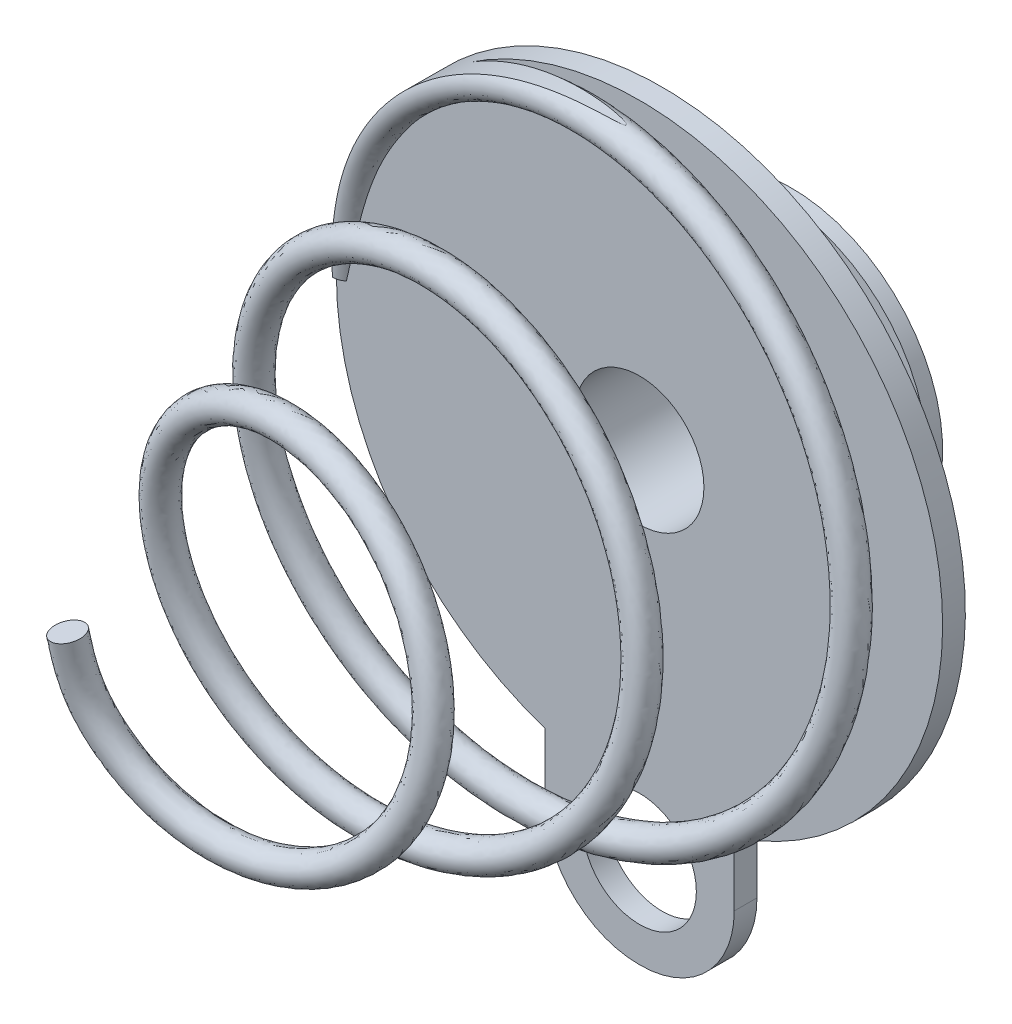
ISO-10303-21;
HEADER;
FILE_DESCRIPTION(('STEP AP214'),'2;1');
FILE_NAME('part.step','',(''),(''),'','','');
FILE_SCHEMA(('AUTOMOTIVE_DESIGN { 1 0 10303 214 1 1 1 1 }'));
ENDSEC;
DATA;
#1=APPLICATION_CONTEXT('core data for automotive mechanical design processes');
#2=APPLICATION_PROTOCOL_DEFINITION('international standard','automotive_design',2000,#1);
#3=PRODUCT_CONTEXT('',#1,'mechanical');
#4=PRODUCT('Part','Part','',(#3));
#5=PRODUCT_RELATED_PRODUCT_CATEGORY('part','',(#4));
#6=PRODUCT_DEFINITION_FORMATION('','',#4);
#7=PRODUCT_DEFINITION_CONTEXT('part definition',#1,'design');
#8=PRODUCT_DEFINITION('design','',#6,#7);
#9=PRODUCT_DEFINITION_SHAPE('','',#8);
#10=(LENGTH_UNIT() NAMED_UNIT(*) SI_UNIT(.MILLI.,.METRE.));
#11=(NAMED_UNIT(*) PLANE_ANGLE_UNIT() SI_UNIT($,.RADIAN.));
#12=(NAMED_UNIT(*) SI_UNIT($,.STERADIAN.) SOLID_ANGLE_UNIT());
#13=UNCERTAINTY_MEASURE_WITH_UNIT(LENGTH_MEASURE(1.E-05),#10,'distance_accuracy_value','');
#14=(GEOMETRIC_REPRESENTATION_CONTEXT(3) GLOBAL_UNCERTAINTY_ASSIGNED_CONTEXT((#13)) GLOBAL_UNIT_ASSIGNED_CONTEXT((#10,
#11,#12)) REPRESENTATION_CONTEXT('',''));
#15=CARTESIAN_POINT('',(0.,0.,0.));
#16=DIRECTION('',(0.,0.,1.));
#17=DIRECTION('',(1.,0.,0.));
#18=AXIS2_PLACEMENT_3D('',#15,#16,#17);
#19=CARTESIAN_POINT('',(0.,0.,-1.85));
#20=DIRECTION('',(0.,0.,1.));
#21=DIRECTION('',(1.,0.,0.));
#22=AXIS2_PLACEMENT_3D('',#19,#20,#21);
#23=CYLINDRICAL_SURFACE('',#22,1.);
#24=CARTESIAN_POINT('',(0.,0.,-0.15));
#25=DIRECTION('',(0.,0.,1.));
#26=DIRECTION('',(1.,0.,0.));
#27=AXIS2_PLACEMENT_3D('',#24,#25,#26);
#28=CIRCLE('',#27,1.);
#29=CARTESIAN_POINT('',(1.,0.,-0.15));
#30=VERTEX_POINT('',#29);
#31=EDGE_CURVE('E133',#30,#30,#28,.T.);
#32=ORIENTED_EDGE('',*,*,#31,.F.);
#33=EDGE_LOOP('',(#32));
#34=FACE_BOUND('',#33,.T.);
#35=CARTESIAN_POINT('',(0.,0.,-1.65));
#36=DIRECTION('',(0.,0.,-1.));
#37=DIRECTION('',(-1.,0.,0.));
#38=AXIS2_PLACEMENT_3D('',#35,#36,#37);
#39=CIRCLE('',#38,1.);
#40=CARTESIAN_POINT('',(-1.,0.,-1.65));
#41=VERTEX_POINT('',#40);
#42=EDGE_CURVE('E157',#41,#41,#39,.F.);
#43=ORIENTED_EDGE('',*,*,#42,.T.);
#44=EDGE_LOOP('',(#43));
#45=FACE_BOUND('',#44,.T.);
#46=ADVANCED_FACE('F31',(#34,#45),#23,.T.);
#47=CARTESIAN_POINT('',(0.,0.,-1.85));
#48=DIRECTION('',(0.,0.,1.));
#49=DIRECTION('',(1.,0.,0.));
#50=AXIS2_PLACEMENT_3D('',#47,#48,#49);
#51=CYLINDRICAL_SURFACE('',#50,0.85);
#52=CARTESIAN_POINT('',(0.,0.,0.15));
#53=DIRECTION('',(0.,0.,1.));
#54=DIRECTION('',(1.,0.,0.));
#55=AXIS2_PLACEMENT_3D('',#52,#53,#54);
#56=CIRCLE('',#55,0.85);
#57=CARTESIAN_POINT('',(0.85,0.,0.15));
#58=VERTEX_POINT('',#57);
#59=EDGE_CURVE('E153',#58,#58,#56,.T.);
#60=ORIENTED_EDGE('',*,*,#59,.T.);
#61=EDGE_LOOP('',(#60));
#62=FACE_BOUND('',#61,.T.);
#63=CARTESIAN_POINT('',(0.,0.,-1.85));
#64=DIRECTION('',(0.,0.,-1.));
#65=DIRECTION('',(-1.,0.,0.));
#66=AXIS2_PLACEMENT_3D('',#63,#64,#65);
#67=CIRCLE('',#66,0.85);
#68=CARTESIAN_POINT('',(-0.85,0.,-1.85));
#69=VERTEX_POINT('',#68);
#70=EDGE_CURVE('E393',#69,#69,#67,.T.);
#71=ORIENTED_EDGE('',*,*,#70,.T.);
#72=EDGE_LOOP('',(#71));
#73=FACE_BOUND('',#72,.T.);
#74=ADVANCED_FACE('F248',(#62,#73),#51,.F.);
#75=CARTESIAN_POINT('',(0.,0.,0.15));
#76=DIRECTION('',(0.,0.,1.));
#77=DIRECTION('',(1.,0.,0.));
#78=AXIS2_PLACEMENT_3D('',#75,#76,#77);
#79=PLANE('',#78);
#80=CARTESIAN_POINT('',(0.,-4.66999601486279,0.15));
#81=DIRECTION('',(0.,0.,1.));
#82=DIRECTION('',(1.,0.,0.));
#83=AXIS2_PLACEMENT_3D('',#80,#81,#82);
#84=CIRCLE('',#83,0.75);
#85=CARTESIAN_POINT('',(0.75,-4.66999601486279,0.15));
#86=VERTEX_POINT('',#85);
#87=EDGE_CURVE('E390',#86,#86,#84,.T.);
#88=ORIENTED_EDGE('',*,*,#87,.F.);
#89=EDGE_LOOP('',(#88));
#90=FACE_BOUND('',#89,.T.);
#91=ORIENTED_EDGE('',*,*,#59,.F.);
#92=EDGE_LOOP('',(#91));
#93=FACE_BOUND('',#92,.T.);
#94=DIRECTION('',(0.,1.,0.));
#95=VECTOR('',#94,1.);
#96=CARTESIAN_POINT('',(1.25,0.,0.15));
#97=LINE('',#96,#95);
#98=CARTESIAN_POINT('',(1.25,-4.64026576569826,0.150000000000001));
#99=VERTEX_POINT('',#98);
#100=CARTESIAN_POINT('',(1.25,-3.79967103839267,0.150000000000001));
#101=VERTEX_POINT('',#100);
#102=EDGE_CURVE('E225',#99,#101,#97,.T.);
#103=ORIENTED_EDGE('',*,*,#102,.T.);
#104=CARTESIAN_POINT('',(0.,0.,0.15));
#105=DIRECTION('',(0.,0.,1.));
#106=DIRECTION('',(1.,0.,0.));
#107=AXIS2_PLACEMENT_3D('',#104,#105,#106);
#108=CIRCLE('',#107,4.);
#109=CARTESIAN_POINT('',(-2.26457137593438,3.29722860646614,0.149999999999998));
#110=VERTEX_POINT('',#109);
#111=EDGE_CURVE('E220',#101,#110,#108,.T.);
#112=ORIENTED_EDGE('',*,*,#111,.T.);
#113=CARTESIAN_POINT('',(-3.99999999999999,1.04414830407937,0.15));
#114=CARTESIAN_POINT('',(-3.99282968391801,1.07563880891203,0.150000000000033));
#115=CARTESIAN_POINT('',(-3.9853004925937,1.10704842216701,0.150000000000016));
#116=CARTESIAN_POINT('',(-3.96948688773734,1.16967342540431,0.149999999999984));
#117=CARTESIAN_POINT('',(-3.96120254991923,1.20088883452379,0.149999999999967));
#118=CARTESIAN_POINT('',(-3.94383414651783,1.2631194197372,0.150000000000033));
#119=CARTESIAN_POINT('',(-3.9347495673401,1.29413445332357,0.150000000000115));
#120=CARTESIAN_POINT('',(-3.9157435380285,1.35591189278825,0.149999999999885));
#121=CARTESIAN_POINT('',(-3.90582190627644,1.38667424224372,0.149999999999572));
#122=CARTESIAN_POINT('',(-3.8674718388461,1.50002624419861,0.149999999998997));
#123=CARTESIAN_POINT('',(-3.83628429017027,1.58171885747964,0.149999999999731));
#124=CARTESIAN_POINT('',(-3.76666571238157,1.74197543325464,0.150000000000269));
#125=CARTESIAN_POINT('',(-3.72823317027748,1.8205387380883,0.150000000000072));
#126=CARTESIAN_POINT('',(-3.64479141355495,1.97427386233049,0.149999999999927));
#127=CARTESIAN_POINT('',(-3.5997692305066,2.04943860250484,0.149999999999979));
#128=CARTESIAN_POINT('',(-3.50394634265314,2.19599716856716,0.150000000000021));
#129=CARTESIAN_POINT('',(-3.45314439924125,2.26739018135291,0.150000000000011));
#130=CARTESIAN_POINT('',(-3.34534686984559,2.40759393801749,0.149999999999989));
#131=CARTESIAN_POINT('',(-3.28824854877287,2.47632554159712,0.149999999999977));
#132=CARTESIAN_POINT('',(-3.16911728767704,2.60937089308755,0.150000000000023));
#133=CARTESIAN_POINT('',(-3.10708438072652,2.67368467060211,0.150000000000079));
#134=CARTESIAN_POINT('',(-2.97851275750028,2.79733523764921,0.149999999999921));
#135=CARTESIAN_POINT('',(-2.91198453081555,2.85668293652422,0.149999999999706));
#136=CARTESIAN_POINT('',(-2.77462304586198,2.97013839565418,0.150000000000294));
#137=CARTESIAN_POINT('',(-2.70379139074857,3.02424808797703,0.150000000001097));
#138=CARTESIAN_POINT('',(-2.59081852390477,3.10363635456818,0.15000000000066));
#139=CARTESIAN_POINT('',(-2.55009031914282,3.13094288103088,0.150000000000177));
#140=CARTESIAN_POINT('',(-2.46740049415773,3.18363708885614,0.149999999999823));
#141=CARTESIAN_POINT('',(-2.42543878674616,3.20902463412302,0.149999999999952));
#142=CARTESIAN_POINT('',(-2.34015797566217,3.25773727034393,0.150000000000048));
#143=CARTESIAN_POINT('',(-2.29683501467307,3.2810556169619,0.150000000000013));
#144=CARTESIAN_POINT('',(-2.20895349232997,3.32520670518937,0.149999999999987));
#145=CARTESIAN_POINT('',(-2.16439558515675,3.34604073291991,0.149999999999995));
#146=CARTESIAN_POINT('',(-2.09651676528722,3.37498130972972,0.150000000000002));
#147=CARTESIAN_POINT('',(-2.07369083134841,3.38425212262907,0.150000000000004));
#148=CARTESIAN_POINT('',(-2.02766773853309,3.40186162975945,0.149999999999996));
#149=CARTESIAN_POINT('',(-2.00447040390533,3.41019986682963,0.149999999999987));
#150=CARTESIAN_POINT('',(-1.95782897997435,3.42563892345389,0.150000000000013));
#151=CARTESIAN_POINT('',(-1.93438760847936,3.43274770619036,0.150000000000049));
#152=CARTESIAN_POINT('',(-1.89886918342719,3.44208046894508,0.149999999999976));
#153=CARTESIAN_POINT('',(-1.88696719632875,3.44497022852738,0.14999999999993));
#154=CARTESIAN_POINT('',(-1.86303334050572,3.45013949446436,0.15000000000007));
#155=CARTESIAN_POINT('',(-1.85100157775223,3.45241946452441,0.150000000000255));
#156=CARTESIAN_POINT('',(-1.83087322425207,3.45540348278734,0.149999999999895));
#157=CARTESIAN_POINT('',(-1.82281702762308,3.45637968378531,0.149999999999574));
#158=CARTESIAN_POINT('',(-1.80666017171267,3.45768042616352,0.150000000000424));
#159=CARTESIAN_POINT('',(-1.79855973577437,3.4580070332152,0.150000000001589));
#160=CARTESIAN_POINT('',(-1.78639393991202,3.45753761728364,0.1500000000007));
#161=CARTESIAN_POINT('',(-1.78231564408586,3.45721719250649,0.149999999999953));
#162=CARTESIAN_POINT('',(-1.77424581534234,3.45604790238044,0.150000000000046));
#163=CARTESIAN_POINT('',(-1.77025394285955,3.45520177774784,0.150000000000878));
#164=CARTESIAN_POINT('',(-1.76332451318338,3.45277828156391,0.150000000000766));
#165=CARTESIAN_POINT('',(-1.7603365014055,3.451382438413,0.150000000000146));
#166=CARTESIAN_POINT('',(-1.75610573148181,3.44821314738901,0.14999999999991));
#167=CARTESIAN_POINT('',(-1.7546296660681,3.4467803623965,0.150000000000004));
#168=CARTESIAN_POINT('',(-1.75228546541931,3.44344941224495,0.149999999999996));
#169=CARTESIAN_POINT('',(-1.75142136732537,3.44154826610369,0.149999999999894));
#170=CARTESIAN_POINT('',(-1.75048353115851,3.43777716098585,0.150000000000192));
#171=CARTESIAN_POINT('',(-1.7503405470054,3.4359224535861,0.150000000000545));
#172=CARTESIAN_POINT('',(-1.75053843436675,3.43083224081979,0.150000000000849));
#173=CARTESIAN_POINT('',(-1.75133538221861,3.42763052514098,0.150000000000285));
#174=CARTESIAN_POINT('',(-1.75392554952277,3.42038001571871,0.149999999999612));
#175=CARTESIAN_POINT('',(-1.75597464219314,3.41644294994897,0.149999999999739));
#176=CARTESIAN_POINT('',(-1.76056678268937,3.40884834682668,0.150000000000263));
#177=CARTESIAN_POINT('',(-1.76311322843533,3.40519298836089,0.150000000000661));
#178=CARTESIAN_POINT('',(-1.77161395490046,3.39390439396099,0.150000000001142));
#179=CARTESIAN_POINT('',(-1.77805488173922,3.38664718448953,0.150000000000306));
#180=CARTESIAN_POINT('',(-1.79141476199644,3.37258203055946,0.149999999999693));
#181=CARTESIAN_POINT('',(-1.79833498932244,3.3657753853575,0.149999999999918));
#182=CARTESIAN_POINT('',(-1.8124488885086,3.35243940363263,0.150000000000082));
#183=CARTESIAN_POINT('',(-1.81964274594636,3.34591026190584,0.150000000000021));
#184=CARTESIAN_POINT('',(-1.83417691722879,3.3330419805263,0.149999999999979));
#185=CARTESIAN_POINT('',(-1.84151699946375,3.32670257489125,0.149999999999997));
#186=CARTESIAN_POINT('',(-1.8635045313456,3.30801691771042,0.150000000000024));
#187=CARTESIAN_POINT('',(-1.87829726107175,3.29584196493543,0.150000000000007));
#188=CARTESIAN_POINT('',(-1.90805516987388,3.27170417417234,0.149999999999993));
#189=CARTESIAN_POINT('',(-1.92302036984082,3.25974136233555,0.149999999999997));
#190=CARTESIAN_POINT('',(-1.96803929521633,3.22396299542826,0.150000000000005));
#191=CARTESIAN_POINT('',(-1.9981944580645,3.20027531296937,0.150000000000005));
#192=CARTESIAN_POINT('',(-2.0583493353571,3.15277813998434,0.149999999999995));
#193=CARTESIAN_POINT('',(-2.08834919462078,3.1289688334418,0.149999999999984));
#194=CARTESIAN_POINT('',(-2.14805994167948,3.08100161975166,0.150000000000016));
#195=CARTESIAN_POINT('',(-2.1777708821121,3.05684377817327,0.150000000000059));
#196=CARTESIAN_POINT('',(-2.26464960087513,2.98503221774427,0.150000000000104));
#197=CARTESIAN_POINT('',(-2.32127529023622,2.93671461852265,0.150000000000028));
#198=CARTESIAN_POINT('',(-2.43259833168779,2.83791014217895,0.149999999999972));
#199=CARTESIAN_POINT('',(-2.48729561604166,2.7874231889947,0.14999999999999));
#200=CARTESIAN_POINT('',(-2.64812587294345,2.63236190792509,0.15000000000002));
#201=CARTESIAN_POINT('',(-2.75092588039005,2.52424490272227,0.150000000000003));
#202=CARTESIAN_POINT('',(-2.89664927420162,2.355180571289,0.149999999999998));
#203=CARTESIAN_POINT('',(-2.94373725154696,2.29778221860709,0.15));
#204=CARTESIAN_POINT('',(-3.0349653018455,2.18069150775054,0.15));
#205=CARTESIAN_POINT('',(-3.07910509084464,2.12099892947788,0.149999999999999));
#206=CARTESIAN_POINT('',(-3.20630314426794,1.9384919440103,0.150000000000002));
#207=CARTESIAN_POINT('',(-3.28433970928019,1.81202091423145,0.150000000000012));
#208=CARTESIAN_POINT('',(-3.37052220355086,1.64884301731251,0.149999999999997));
#209=CARTESIAN_POINT('',(-3.38697676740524,1.61640518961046,0.149999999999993));
#210=CARTESIAN_POINT('',(-3.41876164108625,1.55098309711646,0.150000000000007));
#211=CARTESIAN_POINT('',(-3.43409203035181,1.51799887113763,0.150000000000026));
#212=CARTESIAN_POINT('',(-3.47845311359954,1.41832852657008,0.149999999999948));
#213=CARTESIAN_POINT('',(-3.50585850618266,1.35091564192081,0.149999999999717));
#214=CARTESIAN_POINT('',(-3.55690407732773,1.21462750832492,0.150000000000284));
#215=CARTESIAN_POINT('',(-3.580540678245,1.14575093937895,0.150000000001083));
#216=CARTESIAN_POINT('',(-3.62466132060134,1.00699862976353,0.149999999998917));
#217=CARTESIAN_POINT('',(-3.6451451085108,0.937122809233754,0.149999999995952));
#218=CARTESIAN_POINT('',(-3.69111190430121,0.769266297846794,0.14999999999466));
#219=CARTESIAN_POINT('',(-3.71542214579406,0.670969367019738,0.149999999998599));
#220=CARTESIAN_POINT('',(-3.76154048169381,0.473873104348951,0.150000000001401));
#221=CARTESIAN_POINT('',(-3.78334990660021,0.375074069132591,0.150000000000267));
#222=CARTESIAN_POINT('',(-3.81540232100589,0.230186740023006,0.149999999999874));
#223=CARTESIAN_POINT('',(-3.82561001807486,0.184091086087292,0.149999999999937));
#224=CARTESIAN_POINT('',(-3.84634571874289,0.091973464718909,0.150000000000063));
#225=CARTESIAN_POINT('',(-3.85687371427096,0.0459514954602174,0.150000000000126));
#226=CARTESIAN_POINT('',(-3.86771243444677,0.,0.15));
#227=B_SPLINE_CURVE_WITH_KNOTS('',3,(#113,#114,#115,#116,#117,#118,#119,#120,#121,#122,#123,
#124,#125,#126,#127,#128,#129,#130,#131,#132,#133,#134,#135,#136,#137,#138,#139,#140,#141,#142,
#143,#144,#145,#146,#147,#148,#149,#150,#151,#152,#153,#154,#155,#156,#157,#158,#159,#160,#161,
#162,#163,#164,#165,#166,#167,#168,#169,#170,#171,#172,#173,#174,#175,#176,#177,#178,#179,#180,
#181,#182,#183,#184,#185,#186,#187,#188,#189,#190,#191,#192,#193,#194,#195,#196,#197,#198,#199,
#200,#201,#202,#203,#204,#205,#206,#207,#208,#209,#210,#211,#212,#213,#214,#215,#216,#217,#218,
#219,#220,#221,#222,#223,#224,#225,#226),.UNSPECIFIED.,.F.,.F.,(4,2,2,2,2,2,2,2,2,2,2,2,2,2,2,2,
2,2,2,2,2,2,2,2,2,2,2,2,2,2,2,2,2,2,2,2,2,2,2,2,2,2,2,2,2,2,2,2,2,2,2,2,2,2,2,2,4),(0.,
0.0968884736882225,0.193767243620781,0.290708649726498,0.387671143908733,0.649653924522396,
0.911691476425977,1.17425183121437,1.43686855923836,1.70468618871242,1.97250202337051,
2.23971317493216,2.50682538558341,2.65388739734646,2.80095982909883,2.94849525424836,
3.0959539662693,3.169848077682,3.24377825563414,3.31721002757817,3.35394487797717,
3.39065171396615,3.41498736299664,3.43924550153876,3.45149819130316,3.46368753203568,
3.47342268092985,3.47948824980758,3.48559346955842,3.49109949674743,3.50083524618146,
3.5140874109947,3.52743349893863,3.55647093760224,3.58558875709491,3.61472668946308,
3.64382165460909,3.70129142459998,3.75876823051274,3.87380648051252,3.98870430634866,
4.10358079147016,4.32683989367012,4.55010683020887,4.99691530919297,5.21955531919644,
5.44221674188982,5.88663587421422,5.99574118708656,6.10483878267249,6.32300319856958,
6.54137349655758,6.75976134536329,7.06345712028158,7.36699056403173,7.50862683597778,
7.6502595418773),.UNSPECIFIED.);
#228=CARTESIAN_POINT('',(-3.86771243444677,0.,0.15));
#229=VERTEX_POINT('',#228);
#230=EDGE_CURVE('E139',#110,#229,#227,.T.);
#231=ORIENTED_EDGE('',*,*,#230,.T.);
#232=DIRECTION('',(1.,0.,0.));
#233=VECTOR('',#232,1.);
#234=CARTESIAN_POINT('',(-4.,0.,0.15));
#235=LINE('',#234,#233);
#236=CARTESIAN_POINT('',(-4.,0.,0.150000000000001));
#237=VERTEX_POINT('',#236);
#238=EDGE_CURVE('E216',#237,#229,#235,.T.);
#239=ORIENTED_EDGE('',*,*,#238,.F.);
#240=CARTESIAN_POINT('',(0.,0.,0.150000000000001));
#241=DIRECTION('',(0.,0.,1.));
#242=DIRECTION('',(1.,0.,0.));
#243=AXIS2_PLACEMENT_3D('',#240,#241,#242);
#244=CIRCLE('',#243,4.);
#245=CARTESIAN_POINT('',(-1.25,-3.79967103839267,0.150000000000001));
#246=VERTEX_POINT('',#245);
#247=EDGE_CURVE('E178',#237,#246,#244,.T.);
#248=ORIENTED_EDGE('',*,*,#247,.T.);
#249=DIRECTION('',(0.,-1.,0.));
#250=VECTOR('',#249,1.);
#251=CARTESIAN_POINT('',(-1.25,0.,0.15));
#252=LINE('',#251,#250);
#253=CARTESIAN_POINT('',(-1.25,-4.64026576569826,0.150000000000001));
#254=VERTEX_POINT('',#253);
#255=EDGE_CURVE('E131',#246,#254,#252,.T.);
#256=ORIENTED_EDGE('',*,*,#255,.T.);
#257=CARTESIAN_POINT('',(-0.01,-4.64026576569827,0.150000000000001));
#258=DIRECTION('',(0.,0.,1.));
#259=DIRECTION('',(1.,0.,0.));
#260=AXIS2_PLACEMENT_3D('',#257,#258,#259);
#261=CIRCLE('',#260,1.24);
#262=CARTESIAN_POINT('',(-0.00999999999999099,-5.88026576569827,0.150000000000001));
#263=VERTEX_POINT('',#262);
#264=EDGE_CURVE('E233',#254,#263,#261,.T.);
#265=ORIENTED_EDGE('',*,*,#264,.T.);
#266=DIRECTION('',(1.,0.,0.));
#267=VECTOR('',#266,1.);
#268=CARTESIAN_POINT('',(0.,-5.88026576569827,0.15));
#269=LINE('',#268,#267);
#270=CARTESIAN_POINT('',(0.00999999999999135,-5.88026576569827,0.150000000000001));
#271=VERTEX_POINT('',#270);
#272=EDGE_CURVE('E231',#263,#271,#269,.T.);
#273=ORIENTED_EDGE('',*,*,#272,.T.);
#274=CARTESIAN_POINT('',(0.01,-4.64026576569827,0.150000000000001));
#275=DIRECTION('',(0.,0.,1.));
#276=DIRECTION('',(1.,0.,0.));
#277=AXIS2_PLACEMENT_3D('',#274,#275,#276);
#278=CIRCLE('',#277,1.24);
#279=EDGE_CURVE('E228',#271,#99,#278,.T.);
#280=ORIENTED_EDGE('',*,*,#279,.T.);
#281=EDGE_LOOP('',(#103,#112,#231,#239,#248,#256,#265,#273,#280));
#282=FACE_BOUND('',#281,.T.);
#283=ADVANCED_FACE('F203',(#90,#93,#282),#79,.T.);
#284=CARTESIAN_POINT('',(-4.,0.,0.));
#285=DIRECTION('',(0.,1.,0.));
#286=DIRECTION('',(0.,0.,1.));
#287=AXIS2_PLACEMENT_3D('',#284,#285,#286);
#288=PLANE('',#287);
#289=DIRECTION('',(0.,0.,1.));
#290=VECTOR('',#289,1.);
#291=CARTESIAN_POINT('',(-4.,0.,-15.));
#292=LINE('',#291,#290);
#293=CARTESIAN_POINT('',(-4.,0.,-0.2));
#294=VERTEX_POINT('',#293);
#295=CARTESIAN_POINT('',(-4.,0.,-0.150000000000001));
#296=VERTEX_POINT('',#295);
#297=EDGE_CURVE('E120',#294,#296,#292,.T.);
#298=ORIENTED_EDGE('',*,*,#297,.F.);
#299=CARTESIAN_POINT('',(-4.,0.,0.));
#300=DIRECTION('',(0.,1.,0.));
#301=DIRECTION('',(0.,0.,1.));
#302=AXIS2_PLACEMENT_3D('',#299,#300,#301);
#303=CIRCLE('',#302,0.2);
#304=CARTESIAN_POINT('',(-3.86771243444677,0.,-0.15));
#305=VERTEX_POINT('',#304);
#306=EDGE_CURVE('E210',#305,#294,#303,.T.);
#307=ORIENTED_EDGE('',*,*,#306,.F.);
#308=DIRECTION('',(1.,0.,0.));
#309=VECTOR('',#308,1.);
#310=CARTESIAN_POINT('',(-4.,0.,-0.15));
#311=LINE('',#310,#309);
#312=EDGE_CURVE('E48',#296,#305,#311,.T.);
#313=ORIENTED_EDGE('',*,*,#312,.F.);
#314=EDGE_LOOP('',(#298,#307,#313));
#315=FACE_BOUND('',#314,.T.);
#316=ADVANCED_FACE('F33',(#315),#288,.F.);
#317=CARTESIAN_POINT('',(-4.,0.,0.200000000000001));
#318=VERTEX_POINT('',#317);
#319=EDGE_CURVE('E122',#237,#318,#292,.T.);
#320=ORIENTED_EDGE('',*,*,#319,.F.);
#321=ORIENTED_EDGE('',*,*,#238,.T.);
#322=EDGE_CURVE('E56',#318,#229,#303,.T.);
#323=ORIENTED_EDGE('',*,*,#322,.F.);
#324=EDGE_LOOP('',(#320,#321,#323));
#325=FACE_BOUND('',#324,.T.);
#326=ADVANCED_FACE('F239',(#325),#288,.F.);
#327=CARTESIAN_POINT('',(-4.,0.,0.2));
#328=CARTESIAN_POINT('',(-3.95955414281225,0.278530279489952,0.22231873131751));
#329=CARTESIAN_POINT('',(-3.88019416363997,0.831714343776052,0.266636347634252));
#330=CARTESIAN_POINT('',(-3.63186594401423,1.63967999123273,0.33515891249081));
#331=CARTESIAN_POINT('',(-3.17585543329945,2.35401811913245,0.403186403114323));
#332=CARTESIAN_POINT('',(-2.57881752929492,2.95453459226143,0.471251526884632));
#333=CARTESIAN_POINT('',(-1.86945368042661,3.41853640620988,0.540499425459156));
#334=CARTESIAN_POINT('',(-1.07763703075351,3.7169636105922,0.610139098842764));
#335=CARTESIAN_POINT('',(-0.239708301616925,3.83635074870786,0.680021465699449));
#336=CARTESIAN_POINT('',(0.604434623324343,3.76840666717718,0.750499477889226));
#337=CARTESIAN_POINT('',(1.41293679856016,3.51674324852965,0.821507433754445));
#338=CARTESIAN_POINT('',(2.14482614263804,3.09100035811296,0.892996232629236));
#339=CARTESIAN_POINT('',(2.76357270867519,2.51298302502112,0.965024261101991));
#340=CARTESIAN_POINT('',(3.22775405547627,1.82173380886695,1.03635330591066));
#341=CARTESIAN_POINT('',(3.52203069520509,1.05905829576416,1.1069765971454));
#342=CARTESIAN_POINT('',(3.64188736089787,0.264691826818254,1.17685270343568));
#343=CARTESIAN_POINT('',(3.58434158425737,-0.536572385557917,1.24726413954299));
#344=CARTESIAN_POINT('',(3.35249232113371,-1.30575421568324,1.31819259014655));
#345=CARTESIAN_POINT('',(2.95473931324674,-2.00378317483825,1.38966023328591));
#346=CARTESIAN_POINT('',(2.41158475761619,-2.5957288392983,1.46169312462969));
#347=CARTESIAN_POINT('',(1.74856085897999,-3.04955487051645,1.53426884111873));
#348=CARTESIAN_POINT('',(0.999871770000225,-3.34100716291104,1.60745051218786));
#349=CARTESIAN_POINT('',(0.204299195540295,-3.45362267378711,1.68120053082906));
#350=CARTESIAN_POINT('',(-0.595715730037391,-3.37885024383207,1.75557237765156));
#351=CARTESIAN_POINT('',(-1.35663811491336,-3.12074226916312,1.83056704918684));
#352=CARTESIAN_POINT('',(-2.03548153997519,-2.69069885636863,1.90618545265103));
#353=CARTESIAN_POINT('',(-2.59341536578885,-2.11243398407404,1.9824822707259));
#354=CARTESIAN_POINT('',(-2.99752872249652,-1.41778085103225,2.05943085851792));
#355=CARTESIAN_POINT('',(-3.22190496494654,-0.646127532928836,2.13707338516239));
#356=CARTESIAN_POINT('',(-3.25161239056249,0.12746459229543,2.21256402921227));
#357=CARTESIAN_POINT('',(-3.10699729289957,0.855979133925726,2.28571262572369));
#358=CARTESIAN_POINT('',(-2.81761493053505,1.50790160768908,2.35658192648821));
#359=CARTESIAN_POINT('',(-2.39099870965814,2.07952927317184,2.42802660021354));
#360=CARTESIAN_POINT('',(-1.84686186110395,2.54069240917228,2.50011159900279));
#361=CARTESIAN_POINT('',(-1.21301058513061,2.86777358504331,2.57282750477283));
#362=CARTESIAN_POINT('',(-0.521108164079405,3.04122326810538,2.64619065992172));
#363=CARTESIAN_POINT('',(0.192083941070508,3.05151550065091,2.72024628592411));
#364=CARTESIAN_POINT('',(0.888273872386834,2.89605399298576,2.79496729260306));
#365=CARTESIAN_POINT('',(1.52858106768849,2.58171231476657,2.87042224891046));
#366=CARTESIAN_POINT('',(2.07688154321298,2.12543639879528,2.94659753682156));
#367=CARTESIAN_POINT('',(2.50009608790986,1.5511735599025,3.02352034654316));
#368=CARTESIAN_POINT('',(2.77279333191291,0.892036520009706,3.10123988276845));
#369=CARTESIAN_POINT('',(2.87713019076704,0.186353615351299,3.17973051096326));
#370=CARTESIAN_POINT('',(2.80692690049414,-0.49726270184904,3.25615512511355));
#371=CARTESIAN_POINT('',(2.58805098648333,-1.11904809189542,3.3303312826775));
#372=CARTESIAN_POINT('',(2.24949422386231,-1.65401623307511,3.40224583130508));
#373=CARTESIAN_POINT('',(1.79919582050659,-2.09892721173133,3.47489438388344));
#374=CARTESIAN_POINT('',(1.25947859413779,-2.42976811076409,3.54825053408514));
#375=CARTESIAN_POINT('',(0.658030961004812,-2.62720733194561,3.62238413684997));
#376=CARTESIAN_POINT('',(0.027246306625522,-2.68003573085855,3.69728969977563));
#377=CARTESIAN_POINT('',(-0.598271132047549,-2.58284850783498,3.77299294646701));
#378=CARTESIAN_POINT('',(-1.18288773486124,-2.34022520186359,3.84954880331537));
#379=CARTESIAN_POINT('',(-1.69234220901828,-1.96455269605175,3.9269397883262));
#380=CARTESIAN_POINT('',(-2.09514081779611,-1.47627936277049,4.00523504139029));
#381=CARTESIAN_POINT('',(-2.36618506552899,-0.90433465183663,4.08445252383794));
#382=CARTESIAN_POINT('',(-2.48668149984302,-0.282956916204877,4.16460469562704));
#383=CARTESIAN_POINT('',(-2.44705540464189,0.348740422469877,4.24576909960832));
#384=CARTESIAN_POINT('',(-2.24852248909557,0.94959231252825,4.32793691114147));
#385=CARTESIAN_POINT('',(-1.93033490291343,1.43531523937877,4.4042982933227));
#386=CARTESIAN_POINT('',(-1.54979578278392,1.79689934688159,4.47442894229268));
#387=CARTESIAN_POINT('',(-1.14937720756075,2.04834591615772,4.53822010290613));
#388=CARTESIAN_POINT('',(-0.706628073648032,2.21405008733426,4.60269570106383));
#389=CARTESIAN_POINT('',(-0.239605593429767,2.2869694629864,4.66782485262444));
#390=CARTESIAN_POINT('',(0.232399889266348,2.26230722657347,4.73368666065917));
#391=CARTESIAN_POINT('',(0.689124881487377,2.14096549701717,4.8002500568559));
#392=CARTESIAN_POINT('',(1.11009509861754,1.92630368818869,4.8675858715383));
#393=CARTESIAN_POINT('',(1.47634963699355,1.62787147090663,4.93568569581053));
#394=CARTESIAN_POINT('',(1.76987626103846,1.25770088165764,5.00459422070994));
#395=CARTESIAN_POINT('',(1.97645661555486,0.832957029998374,5.07434448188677));
#396=CARTESIAN_POINT('',(2.08484953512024,0.37331520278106,5.14493689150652));
#397=CARTESIAN_POINT('',(2.08828640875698,-0.0815187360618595,5.21383128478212));
#398=CARTESIAN_POINT('',(1.99896994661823,-0.50869676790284,5.28081616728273));
#399=CARTESIAN_POINT('',(1.83174079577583,-0.892925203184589,5.34594136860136));
#400=CARTESIAN_POINT('',(1.58967030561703,-1.23482790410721,5.41181809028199));
#401=CARTESIAN_POINT('',(1.28172852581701,-1.51878461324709,5.47854763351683));
#402=CARTESIAN_POINT('',(0.921425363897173,-1.73211665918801,5.5460873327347));
#403=CARTESIAN_POINT('',(0.523884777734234,-1.86350543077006,5.61455451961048));
#404=CARTESIAN_POINT('',(0.107425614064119,-1.9062563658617,5.68394297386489));
#405=CARTESIAN_POINT('',(-0.308113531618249,-1.85744169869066,5.75418312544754));
#406=CARTESIAN_POINT('',(-0.702761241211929,-1.71905175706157,5.82544460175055));
#407=CARTESIAN_POINT('',(-1.05384131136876,-1.4908370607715,5.89815976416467));
#408=CARTESIAN_POINT('',(-1.34684599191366,-1.193133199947,5.97139603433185));
#409=CARTESIAN_POINT('',(-1.57409379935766,-0.840994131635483,6.0450490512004));
#410=CARTESIAN_POINT('',(-1.67196014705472,-0.433928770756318,6.12242305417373));
#411=CARTESIAN_POINT('',(-1.68138576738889,-0.158676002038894,6.17320315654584));
#412=CARTESIAN_POINT('',(-1.68759339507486,-0.0201802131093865,6.19876545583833));
#413=CARTESIAN_POINT('',(-3.6,0.,0.2));
#414=CARTESIAN_POINT('',(-3.55951483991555,0.278800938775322,0.222340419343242));
#415=CARTESIAN_POINT('',(-3.47849824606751,0.816170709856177,0.265779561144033));
#416=CARTESIAN_POINT('',(-3.24385775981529,1.52418171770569,0.3251039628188));
#417=CARTESIAN_POINT('',(-2.8299265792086,2.14690012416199,0.395710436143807));
#418=CARTESIAN_POINT('',(-2.28147475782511,2.68305671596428,0.467385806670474));
#419=CARTESIAN_POINT('',(-1.63562609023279,3.08999739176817,0.534510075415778));
#420=CARTESIAN_POINT('',(-0.922714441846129,3.34471341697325,0.603503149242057));
#421=CARTESIAN_POINT('',(-0.168582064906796,3.43949322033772,0.674353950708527));
#422=CARTESIAN_POINT('',(0.585833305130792,3.36552080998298,0.744727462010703));
#423=CARTESIAN_POINT('',(1.30592116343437,3.12793259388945,0.815529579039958));
#424=CARTESIAN_POINT('',(1.95384209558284,2.73565748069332,0.887352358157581));
#425=CARTESIAN_POINT('',(2.4972567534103,2.21000690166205,0.959155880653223));
#426=CARTESIAN_POINT('',(2.90127295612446,1.58493039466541,1.03085118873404));
#427=CARTESIAN_POINT('',(3.15115608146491,0.900959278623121,1.10124479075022));
#428=CARTESIAN_POINT('',(3.24561741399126,0.190235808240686,1.17140195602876));
#429=CARTESIAN_POINT('',(3.18133068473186,-0.521321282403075,1.24174615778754));
#430=CARTESIAN_POINT('',(2.96272341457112,-1.20225425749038,1.31270041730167));
#431=CARTESIAN_POINT('',(2.59778063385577,-1.8158158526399,1.38438833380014));
#432=CARTESIAN_POINT('',(2.10626186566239,-2.33210199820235,1.45619730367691));
#433=CARTESIAN_POINT('',(1.51012483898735,-2.72403536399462,1.52917377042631));
#434=CARTESIAN_POINT('',(0.842837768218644,-2.96926911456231,1.60213166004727));
#435=CARTESIAN_POINT('',(0.13603059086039,-3.05587189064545,1.67613218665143));
#436=CARTESIAN_POINT('',(-0.569346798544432,-2.97599211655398,1.75055547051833));
#437=CARTESIAN_POINT('',(-1.23681777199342,-2.73526041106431,1.8254023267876));
#438=CARTESIAN_POINT('',(-1.82859039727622,-2.34389968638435,1.90142199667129));
#439=CARTESIAN_POINT('',(-2.30939562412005,-1.82530910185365,1.97751058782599));
#440=CARTESIAN_POINT('',(-2.65337081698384,-1.2064064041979,2.05468284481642));
#441=CARTESIAN_POINT('',(-2.83655323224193,-0.524534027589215,2.13246154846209));
#442=CARTESIAN_POINT('',(-2.84893327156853,0.154525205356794,2.20774741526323));
#443=CARTESIAN_POINT('',(-2.70891302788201,0.791373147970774,2.28133895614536));
#444=CARTESIAN_POINT('',(-2.44400151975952,1.35595715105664,2.3519619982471));
#445=CARTESIAN_POINT('',(-2.06005946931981,1.84891216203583,2.42371742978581));
#446=CARTESIAN_POINT('',(-1.57672945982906,2.24096902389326,2.49580851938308));
#447=CARTESIAN_POINT('',(-1.01761838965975,2.51477939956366,2.56843391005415));
#448=CARTESIAN_POINT('',(-0.411490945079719,2.65276312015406,2.64220536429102));
#449=CARTESIAN_POINT('',(0.208382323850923,2.64822348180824,2.71597745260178));
#450=CARTESIAN_POINT('',(0.811053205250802,2.49979634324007,2.79113188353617));
#451=CARTESIAN_POINT('',(1.35953040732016,2.21496764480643,2.86651374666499));
#452=CARTESIAN_POINT('',(1.82593219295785,1.8090662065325,2.94266192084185));
#453=CARTESIAN_POINT('',(2.18054163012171,1.30398394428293,3.01999530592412));
#454=CARTESIAN_POINT('',(2.40260899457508,0.730199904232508,3.09747919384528));
#455=CARTESIAN_POINT('',(2.47867560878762,0.119104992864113,3.17630547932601));
#456=CARTESIAN_POINT('',(2.40424286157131,-0.46714882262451,3.2528736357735));
#457=CARTESIAN_POINT('',(2.2037300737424,-0.996657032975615,3.32680913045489));
#458=CARTESIAN_POINT('',(1.90206368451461,-1.44884796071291,3.39928886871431));
#459=CARTESIAN_POINT('',(1.50787958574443,-1.81972156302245,3.47161502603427));
#460=CARTESIAN_POINT('',(1.03895273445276,-2.09176316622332,3.54542504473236));
#461=CARTESIAN_POINT('',(0.52236085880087,-2.24696990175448,3.61954740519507));
#462=CARTESIAN_POINT('',(-0.0162045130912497,-2.27867871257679,3.69436501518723));
#463=CARTESIAN_POINT('',(-0.545830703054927,-2.1823768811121,3.7705960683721));
#464=CARTESIAN_POINT('',(-1.03573060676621,-1.96407689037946,3.84686566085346));
#465=CARTESIAN_POINT('',(-1.45942783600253,-1.63446298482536,3.92469247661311));
#466=CARTESIAN_POINT('',(-1.78820114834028,-1.21332281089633,4.00310752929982));
#467=CARTESIAN_POINT('',(-2.00377571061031,-0.725418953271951,4.08213088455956));
#468=CARTESIAN_POINT('',(-2.09104643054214,-0.199591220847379,4.16287007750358));
#469=CARTESIAN_POINT('',(-2.04307195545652,0.328697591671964,4.24402831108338));
#470=CARTESIAN_POINT('',(-1.86309097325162,0.826932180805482,4.32603322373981));
#471=CARTESIAN_POINT('',(-1.5856849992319,1.22518767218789,4.40313891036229));
#472=CARTESIAN_POINT('',(-1.26089441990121,1.51642716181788,4.47286372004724));
#473=CARTESIAN_POINT('',(-0.921417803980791,1.71633088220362,4.53732322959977));
#474=CARTESIAN_POINT('',(-0.55129840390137,1.84242155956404,4.60142449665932));
#475=CARTESIAN_POINT('',(-0.162219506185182,1.89162202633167,4.6671835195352));
#476=CARTESIAN_POINT('',(0.225590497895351,1.85944879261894,4.73278313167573));
#477=CARTESIAN_POINT('',(0.599555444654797,1.74807513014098,4.79982608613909));
#478=CARTESIAN_POINT('',(0.938872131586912,1.56141526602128,4.86714083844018));
#479=CARTESIAN_POINT('',(1.2319405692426,1.30732321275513,4.9353972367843));
#480=CARTESIAN_POINT('',(1.46164388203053,0.997720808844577,5.00472025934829));
#481=CARTESIAN_POINT('',(1.61902493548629,0.646294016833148,5.07407040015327));
#482=CARTESIAN_POINT('',(1.69490395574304,0.269981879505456,5.14561626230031));
#483=CARTESIAN_POINT('',(1.68556260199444,-0.0977303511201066,5.21395442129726));
#484=CARTESIAN_POINT('',(1.60190934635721,-0.440941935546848,5.28188340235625));
#485=CARTESIAN_POINT('',(1.45713219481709,-0.744755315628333,5.34649300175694));
#486=CARTESIAN_POINT('',(1.25309844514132,-1.01330146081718,5.41324016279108));
#487=CARTESIAN_POINT('',(0.999581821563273,-1.23102862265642,5.47957722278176));
#488=CARTESIAN_POINT('',(0.705611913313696,-1.39169290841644,5.54794103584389));
#489=CARTESIAN_POINT('',(0.386918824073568,-1.48430367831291,5.61628422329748));
#490=CARTESIAN_POINT('',(0.055294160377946,-1.5064234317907,5.68536293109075));
#491=CARTESIAN_POINT('',(-0.270497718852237,-1.45582046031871,5.75680169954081));
#492=CARTESIAN_POINT('',(-0.575832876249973,-1.33601367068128,5.83005382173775));
#493=CARTESIAN_POINT('',(-0.843179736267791,-1.14691123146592,5.89790568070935));
#494=CARTESIAN_POINT('',(-1.06757017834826,-0.902397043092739,5.97248945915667));
#495=CARTESIAN_POINT('',(-1.22890261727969,-0.62705266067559,6.05895592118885));
#496=CARTESIAN_POINT('',(-1.2805065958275,-0.335986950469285,6.11647968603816));
#497=CARTESIAN_POINT('',(-1.28914787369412,-0.0811709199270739,6.16284839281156));
#498=CARTESIAN_POINT('',(-1.29536905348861,0.0576272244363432,6.18846649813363));
#499=CARTESIAN_POINT('',(-3.6,0.,-0.2));
#500=CARTESIAN_POINT('',(-3.55951483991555,0.278800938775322,-0.177659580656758));
#501=CARTESIAN_POINT('',(-3.47949589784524,0.81633197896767,-0.134242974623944));
#502=CARTESIAN_POINT('',(-3.25303768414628,1.52906590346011,-0.0747781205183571));
#503=CARTESIAN_POINT('',(-2.83536203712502,2.15240526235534,-0.00421849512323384));
#504=CARTESIAN_POINT('',(-2.28339906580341,2.68676146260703,0.0674036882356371));
#505=CARTESIAN_POINT('',(-1.63747736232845,3.09613944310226,0.134560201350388));
#506=CARTESIAN_POINT('',(-0.923046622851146,3.35182718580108,0.203565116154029));
#507=CARTESIAN_POINT('',(-0.167133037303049,3.44556976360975,0.274401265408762));
#508=CARTESIAN_POINT('',(0.588810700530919,3.37123409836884,0.34477836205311));
#509=CARTESIAN_POINT('',(1.31046355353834,3.13294864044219,0.415585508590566));
#510=CARTESIAN_POINT('',(1.95937758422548,2.7391692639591,0.487404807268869));
#511=CARTESIAN_POINT('',(2.50381802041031,2.21214036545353,0.559214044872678));
#512=CARTESIAN_POINT('',(2.90796705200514,1.58518694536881,0.630905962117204));
#513=CARTESIAN_POINT('',(3.15805455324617,0.899552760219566,0.701305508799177));
#514=CARTESIAN_POINT('',(3.25182027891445,0.187078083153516,0.771461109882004));
#515=CARTESIAN_POINT('',(3.18674217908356,-0.526012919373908,0.841809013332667));
#516=CARTESIAN_POINT('',(2.96685963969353,-1.2083188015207,0.912766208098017));
#517=CARTESIAN_POINT('',(2.60017475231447,-1.82273315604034,0.98445388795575));
#518=CARTESIAN_POINT('',(2.10697385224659,-2.33978571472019,1.0562700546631));
#519=CARTESIAN_POINT('',(1.50867308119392,-2.73149880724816,1.1292442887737));
#520=CARTESIAN_POINT('',(0.83950686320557,-2.97652592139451,1.20220969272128));
#521=CARTESIAN_POINT('',(0.130782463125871,-3.06198210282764,1.27621120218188));
#522=CARTESIAN_POINT('',(-0.576124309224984,-2.98065059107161,1.35063830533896));
#523=CARTESIAN_POINT('',(-1.2449118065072,-2.73822553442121,1.42549289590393));
#524=CARTESIAN_POINT('',(-1.83717219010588,-2.344410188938,1.50151208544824));
#525=CARTESIAN_POINT('',(-2.31824660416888,-1.82365359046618,1.57760974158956));
#526=CARTESIAN_POINT('',(-2.66157042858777,-1.20226115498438,1.65478548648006));
#527=CARTESIAN_POINT('',(-2.84346628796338,-0.518217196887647,1.73256881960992));
#528=CARTESIAN_POINT('',(-2.85437526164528,0.162700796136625,1.80786511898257));
#529=CARTESIAN_POINT('',(-2.71188299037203,0.800758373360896,1.88145759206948));
#530=CARTESIAN_POINT('',(-2.44489216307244,1.36619605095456,1.95209159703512));
#531=CARTESIAN_POINT('',(-2.05821248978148,1.85920356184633,2.02385098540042));
#532=CARTESIAN_POINT('',(-1.57237279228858,2.25077924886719,2.09595005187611));
#533=CARTESIAN_POINT('',(-1.01081020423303,2.52363906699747,2.16858643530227));
#534=CARTESIAN_POINT('',(-0.402451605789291,2.65952458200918,2.24236135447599));
#535=CARTESIAN_POINT('',(0.219173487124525,2.65299789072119,2.31614795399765));
#536=CARTESIAN_POINT('',(0.822937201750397,2.5014529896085,2.39130751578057));
#537=CARTESIAN_POINT('',(1.37183688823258,2.21367831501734,2.4667016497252));
#538=CARTESIAN_POINT('',(1.83798763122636,1.8046114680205,2.54286337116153));
#539=CARTESIAN_POINT('',(2.19107109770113,1.29624765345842,2.62020394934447));
#540=CARTESIAN_POINT('',(2.41134687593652,0.719786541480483,2.69770530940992));
#541=CARTESIAN_POINT('',(2.48436760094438,0.106356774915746,2.77654271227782));
#542=CARTESIAN_POINT('',(2.4065520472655,-0.481234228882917,2.85312381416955));
#543=CARTESIAN_POINT('',(2.20276538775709,-1.01147510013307,2.9270791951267));
#544=CARTESIAN_POINT('',(1.89715315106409,-1.46309816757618,2.99956728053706));
#545=CARTESIAN_POINT('',(1.4997252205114,-1.83305676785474,3.07191491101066));
#546=CARTESIAN_POINT('',(1.02734839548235,-2.10277660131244,3.14573789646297));
#547=CARTESIAN_POINT('',(0.508109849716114,-2.25513805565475,3.21987899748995));
#548=CARTESIAN_POINT('',(-0.032553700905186,-2.28345081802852,3.2947195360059));
#549=CARTESIAN_POINT('',(-0.563194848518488,-2.18258605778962,3.37096517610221));
#550=CARTESIAN_POINT('',(-1.05328246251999,-1.96016416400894,3.44726192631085));
#551=CARTESIAN_POINT('',(-1.47574059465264,-1.62577868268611,3.52510906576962));
#552=CARTESIAN_POINT('',(-1.8021237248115,-1.20045227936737,3.60354833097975));
#553=CARTESIAN_POINT('',(-2.01456393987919,-0.708972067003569,3.68260338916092));
#554=CARTESIAN_POINT('',(-2.09694863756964,-0.180299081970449,3.76336601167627));
#555=CARTESIAN_POINT('',(-2.0438688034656,0.349432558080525,3.84455613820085));
#556=CARTESIAN_POINT('',(-1.85845729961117,0.847990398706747,3.92659898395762));
#557=CARTESIAN_POINT('',(-1.57532420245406,1.24453168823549,4.00373016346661));
#558=CARTESIAN_POINT('',(-1.24635507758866,1.53370503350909,4.07349232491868));
#559=CARTESIAN_POINT('',(-0.902984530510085,1.73013250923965,4.13797669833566));
#560=CARTESIAN_POINT('',(-0.530008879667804,1.85274141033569,4.20211448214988));
#561=CARTESIAN_POINT('',(-0.138634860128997,1.89694063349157,4.26790322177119));
#562=CARTESIAN_POINT('',(0.250387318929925,1.85997815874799,4.33354138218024));
#563=CARTESIAN_POINT('',(0.624438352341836,1.74288462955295,4.40062081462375));
#564=CARTESIAN_POINT('',(0.962634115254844,1.55081389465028,4.46797539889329));
#565=CARTESIAN_POINT('',(1.25342327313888,1.29136056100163,4.53627731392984));
#566=CARTESIAN_POINT('',(1.47921343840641,0.976787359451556,4.60564078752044));
#567=CARTESIAN_POINT('',(1.63236309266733,0.621441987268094,4.6750475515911));
#568=CARTESIAN_POINT('',(1.70168286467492,0.241990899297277,4.74663592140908));
#569=CARTESIAN_POINT('',(1.68667277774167,-0.127339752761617,4.81503490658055));
#570=CARTESIAN_POINT('',(1.59582381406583,-0.470571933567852,4.88301153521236));
#571=CARTESIAN_POINT('',(1.44523706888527,-0.773441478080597,4.94768229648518));
#572=CARTESIAN_POINT('',(1.23450336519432,-1.03906487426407,5.0144839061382));
#573=CARTESIAN_POINT('',(0.975635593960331,-1.25313249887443,5.08088640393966));
#574=CARTESIAN_POINT('',(0.676454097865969,-1.40804440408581,5.14931535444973));
#575=CARTESIAN_POINT('',(0.354193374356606,-1.49434821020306,5.21773170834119));
#576=CARTESIAN_POINT('',(0.0202132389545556,-1.50962800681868,5.2868911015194));
#577=CARTESIAN_POINT('',(-0.30614943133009,-1.44988024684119,5.358392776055));
#578=CARTESIAN_POINT('',(-0.609354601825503,-1.32014698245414,5.43175038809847));
#579=CARTESIAN_POINT('',(-0.87599357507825,-1.12726377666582,5.49974993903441));
#580=CARTESIAN_POINT('',(-1.09500130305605,-0.874266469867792,5.57426740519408));
#581=CARTESIAN_POINT('',(-1.23789532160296,-0.586870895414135,5.66099361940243));
#582=CARTESIAN_POINT('',(-1.29669462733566,-0.296221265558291,5.71879500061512));
#583=CARTESIAN_POINT('',(-1.30759266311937,-0.0408104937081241,5.7653174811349));
#584=CARTESIAN_POINT('',(-1.31381384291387,0.097987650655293,5.79093558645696));
#585=CARTESIAN_POINT('',(-4.,0.,-0.2));
#586=CARTESIAN_POINT('',(-3.9595344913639,0.278665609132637,-0.177670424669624));
#587=CARTESIAN_POINT('',(-3.88120079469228,0.831813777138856,-0.133391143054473));
#588=CARTESIAN_POINT('',(-3.64104345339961,1.64458080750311,-0.0647218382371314));
#589=CARTESIAN_POINT('',(-3.18129154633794,2.35951874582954,0.00325711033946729));
#590=CARTESIAN_POINT('',(-2.58074166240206,2.95824054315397,0.0712695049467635));
#591=CARTESIAN_POINT('',(-1.87130499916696,3.4246781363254,0.140549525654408));
#592=CARTESIAN_POINT('',(-1.07796919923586,3.72407746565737,0.210201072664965));
#593=CARTESIAN_POINT('',(-0.238259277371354,3.84242726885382,0.280068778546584));
#594=CARTESIAN_POINT('',(0.607412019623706,3.77411996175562,0.350550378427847));
#595=CARTESIAN_POINT('',(1.41747918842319,3.52175929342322,0.421563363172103));
#596=CARTESIAN_POINT('',(2.15036163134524,3.09451214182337,0.493048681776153));
#597=CARTESIAN_POINT('',(2.77013397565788,2.51511648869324,0.565082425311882));
#598=CARTESIAN_POINT('',(3.23444815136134,1.82199035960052,0.636408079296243));
#599=CARTESIAN_POINT('',(3.5289291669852,1.05765177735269,0.707037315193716));
#600=CARTESIAN_POINT('',(3.64809022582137,0.261534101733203,0.776911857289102));
#601=CARTESIAN_POINT('',(3.58975307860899,-0.541264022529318,0.847326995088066));
#602=CARTESIAN_POINT('',(3.35662854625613,-1.3118187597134,0.918258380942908));
#603=CARTESIAN_POINT('',(2.95713343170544,-2.01070047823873,0.989725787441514));
#604=CARTESIAN_POINT('',(2.4122967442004,-2.60341255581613,1.06176587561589));
#605=CARTESIAN_POINT('',(1.74710910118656,-3.05701831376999,1.13433935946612));
#606=CARTESIAN_POINT('',(0.99654086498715,-3.34826396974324,1.20752854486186));
#607=CARTESIAN_POINT('',(0.199051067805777,-3.4597328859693,1.28127954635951));
#608=CARTESIAN_POINT('',(-0.602493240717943,-3.3835087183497,1.35565521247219));
#609=CARTESIAN_POINT('',(-1.36473214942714,-3.12370739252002,1.43065761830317));
#610=CARTESIAN_POINT('',(-2.04406333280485,-2.69120935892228,1.50627554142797));
#611=CARTESIAN_POINT('',(-2.60226634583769,-2.11077847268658,1.58258142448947));
#612=CARTESIAN_POINT('',(-3.00572833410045,-1.41363560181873,1.65953350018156));
#613=CARTESIAN_POINT('',(-3.22881802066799,-0.639810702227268,1.73718065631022));
#614=CARTESIAN_POINT('',(-3.25705438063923,0.13564018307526,1.81268173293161));
#615=CARTESIAN_POINT('',(-3.10996725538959,0.865364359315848,1.8858312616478));
#616=CARTESIAN_POINT('',(-2.81850557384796,1.518140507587,1.95671152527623));
#617=CARTESIAN_POINT('',(-2.38915173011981,2.08982067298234,2.02816015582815));
#618=CARTESIAN_POINT('',(-1.84250519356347,2.5505026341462,2.10025313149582));
#619=CARTESIAN_POINT('',(-1.20620239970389,2.87663325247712,2.17298003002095));
#620=CARTESIAN_POINT('',(-0.512068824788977,3.0479847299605,2.24634665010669));
#621=CARTESIAN_POINT('',(0.202875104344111,3.05628990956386,2.32041678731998));
#622=CARTESIAN_POINT('',(0.90015786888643,2.89771063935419,2.39514292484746));
#623=CARTESIAN_POINT('',(1.54088754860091,2.58042298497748,2.47061015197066));
#624=CARTESIAN_POINT('',(2.08893698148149,2.12098166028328,2.54679898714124));
#625=CARTESIAN_POINT('',(2.51062555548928,1.54343726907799,2.6237289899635));
#626=CARTESIAN_POINT('',(2.78153121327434,0.88162315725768,2.7014659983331));
#627=CARTESIAN_POINT('',(2.88282218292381,0.173605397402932,2.77996774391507));
#628=CARTESIAN_POINT('',(2.80923608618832,-0.511348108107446,2.8564053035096));
#629=CARTESIAN_POINT('',(2.58708630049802,-1.13386615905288,2.93060134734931));
#630=CARTESIAN_POINT('',(2.24458369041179,-1.66826643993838,3.00252424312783));
#631=CARTESIAN_POINT('',(1.79104145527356,-2.11226241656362,3.07519426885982));
#632=CARTESIAN_POINT('',(1.24787425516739,-2.44078154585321,3.14856338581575));
#633=CARTESIAN_POINT('',(0.643779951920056,-2.63537548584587,3.22271572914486));
#634=CARTESIAN_POINT('',(0.0108971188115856,-2.68480783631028,3.2976442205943));
#635=CARTESIAN_POINT('',(-0.615635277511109,-2.5830576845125,3.37336205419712));
#636=CARTESIAN_POINT('',(-1.20043959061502,-2.33631247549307,3.44994506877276));
#637=CARTESIAN_POINT('',(-1.7086549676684,-1.9558683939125,3.52735637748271));
#638=CARTESIAN_POINT('',(-2.10906339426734,-1.46340883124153,3.60567584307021));
#639=CARTESIAN_POINT('',(-2.37697329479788,-0.887887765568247,3.68492502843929));
#640=CARTESIAN_POINT('',(-2.49258370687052,-0.263664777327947,3.76510062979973));
#641=CARTESIAN_POINT('',(-2.44785225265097,0.369475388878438,3.84629692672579));
#642=CARTESIAN_POINT('',(-2.24388881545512,0.970650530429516,3.92850267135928));
#643=CARTESIAN_POINT('',(-1.9199741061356,1.45465925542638,4.00488954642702));
#644=CARTESIAN_POINT('',(-1.53525644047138,1.8141772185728,4.07505754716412));
#645=CARTESIAN_POINT('',(-1.13094393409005,2.06214754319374,4.13887357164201));
#646=CARTESIAN_POINT('',(-0.685338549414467,2.22436993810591,4.20338568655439));
#647=CARTESIAN_POINT('',(-0.216020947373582,2.29228807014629,4.26854455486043));
#648=CARTESIAN_POINT('',(0.257196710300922,2.26283659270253,4.33444491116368));
#649=CARTESIAN_POINT('',(0.714007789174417,2.13577499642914,4.40104478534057));
#650=CARTESIAN_POINT('',(1.13385708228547,1.91570231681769,4.46842043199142));
#651=CARTESIAN_POINT('',(1.49783234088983,1.61190881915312,4.53656577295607));
#652=CARTESIAN_POINT('',(1.78744581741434,1.23676743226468,4.60551474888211));
#653=CARTESIAN_POINT('',(1.98979477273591,0.808105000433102,4.67532163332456));
#654=CARTESIAN_POINT('',(2.09162844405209,0.3453242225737,4.74595655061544));
#655=CARTESIAN_POINT('',(2.08939658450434,-0.111128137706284,4.81491177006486));
#656=CARTESIAN_POINT('',(1.99288441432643,-0.5383267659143,4.8819443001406));
#657=CARTESIAN_POINT('',(1.8198456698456,-0.921611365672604,4.947130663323));
#658=CARTESIAN_POINT('',(1.57107522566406,-1.26059131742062,5.01306183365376));
#659=CARTESIAN_POINT('',(1.2577822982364,-1.54088848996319,5.0798568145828));
#660=CARTESIAN_POINT('',(0.892267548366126,-1.74846815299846,5.14746165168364));
#661=CARTESIAN_POINT('',(0.491159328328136,-1.87354996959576,5.21600200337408));
#662=CARTESIAN_POINT('',(0.072344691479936,-1.90946091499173,5.28547114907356));
#663=CARTESIAN_POINT('',(-0.343765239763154,-1.85150158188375,5.35577418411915));
#664=CARTESIAN_POINT('',(-0.736282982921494,-1.70318470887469,5.42714123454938));
#665=CARTESIAN_POINT('',(-1.08665508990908,-1.47119095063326,5.5000037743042));
#666=CARTESIAN_POINT('',(-1.37427734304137,-1.16499757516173,5.57317491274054));
#667=CARTESIAN_POINT('',(-1.5830856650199,-0.800831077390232,5.64708329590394));
#668=CARTESIAN_POINT('',(-1.68815127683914,-0.394093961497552,5.7247511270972));
#669=CARTESIAN_POINT('',(-1.69982378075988,-0.118466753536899,5.77564434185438));
#670=CARTESIAN_POINT('',(-1.70603818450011,0.0201802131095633,5.80123454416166));
#671=CARTESIAN_POINT('',(-4.4,0.,-0.2));
#672=CARTESIAN_POINT('',(-4.35955414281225,0.278530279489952,-0.17768126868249));
#673=CARTESIAN_POINT('',(-4.28290569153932,0.847295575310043,-0.132539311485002));
#674=CARTESIAN_POINT('',(-4.02904922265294,1.76009571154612,-0.0546655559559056));
#675=CARTESIAN_POINT('',(-3.52722105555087,2.56663222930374,0.0107327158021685));
#676=CARTESIAN_POINT('',(-2.87808425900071,3.22971962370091,0.07513532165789));
#677=CARTESIAN_POINT('',(-2.10513263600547,3.75321682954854,0.146538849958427));
#678=CARTESIAN_POINT('',(-1.23289177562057,4.09632774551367,0.216837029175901));
#679=CARTESIAN_POINT('',(-0.309385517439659,4.23928477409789,0.285736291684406));
#680=CARTESIAN_POINT('',(0.626013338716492,4.1770058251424,0.356322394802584));
#681=CARTESIAN_POINT('',(1.52449482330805,3.91056994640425,0.427541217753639));
#682=CARTESIAN_POINT('',(2.341345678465,3.44985501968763,0.498692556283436));
#683=CARTESIAN_POINT('',(3.03644993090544,2.81809261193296,0.570950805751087));
#684=CARTESIAN_POINT('',(3.56092925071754,2.05879377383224,0.641910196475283));
#685=CARTESIAN_POINT('',(3.89980378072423,1.21575079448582,0.712769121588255));
#686=CARTESIAN_POINT('',(4.04436017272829,0.33599012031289,0.782362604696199));
#687=CARTESIAN_POINT('',(3.99276397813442,-0.556515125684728,0.852844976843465));
#688=CARTESIAN_POINT('',(3.74639745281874,-1.4153187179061,0.9237505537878));
#689=CARTESIAN_POINT('',(3.3140921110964,-2.19866780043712,0.994997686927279));
#690=CARTESIAN_POINT('',(2.7176196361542,-2.86703939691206,1.06726169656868));
#691=CARTESIAN_POINT('',(1.9855451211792,-3.38253782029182,1.13943443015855));
#692=CARTESIAN_POINT('',(1.15357486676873,-3.72000201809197,1.21284739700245));
#693=CARTESIAN_POINT('',(0.267319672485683,-3.85748366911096,1.28634789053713));
#694=CARTESIAN_POINT('',(-0.628862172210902,-3.78636684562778,1.36067211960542));
#695=CARTESIAN_POINT('',(-1.48455249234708,-3.50918925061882,1.43582234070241));
#696=CARTESIAN_POINT('',(-2.25095447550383,-3.03800852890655,1.51103899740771));
#697=CARTESIAN_POINT('',(-2.88628608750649,-2.39790335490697,1.58755310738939));
#698=CARTESIAN_POINT('',(-3.34988623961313,-1.62501004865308,1.66428151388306));
#699=CARTESIAN_POINT('',(-3.6141697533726,-0.761404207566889,1.74179249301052));
#700=CARTESIAN_POINT('',(-3.65973349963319,0.108579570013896,1.81749834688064));
#701=CARTESIAN_POINT('',(-3.50805152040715,0.9299703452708,1.89020493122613));
#702=CARTESIAN_POINT('',(-3.19211898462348,1.67008496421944,1.96133145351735));
#703=CARTESIAN_POINT('',(-2.72009097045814,2.32043778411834,2.03246932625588));
#704=CARTESIAN_POINT('',(-2.11263759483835,2.85022601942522,2.10455621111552));
#705=CARTESIAN_POINT('',(-1.40159459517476,3.22962743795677,2.17737362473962));
#706=CARTESIAN_POINT('',(-0.621686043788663,3.43644487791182,2.2503319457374));
#707=CARTESIAN_POINT('',(0.186576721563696,3.45958192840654,2.32468562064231));
#708=CARTESIAN_POINT('',(0.977378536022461,3.29396828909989,2.39897833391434));
#709=CARTESIAN_POINT('',(1.70993820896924,2.94716765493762,2.47451865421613));
#710=CARTESIAN_POINT('',(2.33988633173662,2.43735185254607,2.55073460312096));
#711=CARTESIAN_POINT('',(2.83018001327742,1.79062688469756,2.62725403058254));
#712=CARTESIAN_POINT('',(3.15171555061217,1.04345977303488,2.70522668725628));
#713=CARTESIAN_POINT('',(3.28127676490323,0.240854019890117,2.78339277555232));
#714=CARTESIAN_POINT('',(3.21192012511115,-0.541461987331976,2.85968679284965));
#715=CARTESIAN_POINT('',(2.97140721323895,-1.25625721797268,2.93412349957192));
#716=CARTESIAN_POINT('',(2.59201422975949,-1.87343471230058,3.0054812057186));
#717=CARTESIAN_POINT('',(2.08235769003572,-2.39146806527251,3.07847362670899));
#718=CARTESIAN_POINT('',(1.46840011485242,-2.77878649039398,3.15138887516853));
#719=CARTESIAN_POINT('',(0.779450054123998,-3.015612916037,3.22555246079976));
#720=CARTESIAN_POINT('',(0.0543479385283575,-3.08616485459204,3.3005689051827));
#721=CARTESIAN_POINT('',(-0.66807570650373,-2.98352931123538,3.37575893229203));
#722=CARTESIAN_POINT('',(-1.34759671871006,-2.7124607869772,3.45262821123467));
#723=CARTESIAN_POINT('',(-1.94156934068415,-2.2859581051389,3.5296036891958));
#724=CARTESIAN_POINT('',(-2.41600306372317,-1.72636538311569,3.60780335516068));
#725=CARTESIAN_POINT('',(-2.73938264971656,-1.06680346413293,3.68724666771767));
#726=CARTESIAN_POINT('',(-2.8882187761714,-0.347030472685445,3.7668352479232));
#727=CARTESIAN_POINT('',(-2.85183570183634,0.389518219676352,3.84803771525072));
#728=CARTESIAN_POINT('',(-2.62932033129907,1.09331066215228,3.93040635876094));
#729=CARTESIAN_POINT('',(-2.26462400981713,1.66478682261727,4.00604892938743));
#730=CARTESIAN_POINT('',(-1.82415780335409,2.0946494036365,4.07662276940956));
#731=CARTESIAN_POINT('',(-1.35890333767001,2.39416257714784,4.13977044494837));
#732=CARTESIAN_POINT('',(-0.84066821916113,2.59599846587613,4.20465689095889));
#733=CARTESIAN_POINT('',(-0.293407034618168,2.68763550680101,4.26918588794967));
#734=CARTESIAN_POINT('',(0.26400610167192,2.66569502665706,4.33534844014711));
#735=CARTESIAN_POINT('',(0.803577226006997,2.52866536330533,4.40146875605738));
#736=CARTESIAN_POINT('',(1.3050800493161,2.2805907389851,4.46886546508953));
#737=CARTESIAN_POINT('',(1.74224140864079,1.9324570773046,4.53685423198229));
#738=CARTESIAN_POINT('',(2.09567819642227,1.49674750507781,4.60538871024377));
#739=CARTESIAN_POINT('',(2.34722645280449,0.994768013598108,4.67559571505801));
#740=CARTESIAN_POINT('',(2.48157402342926,0.448657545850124,4.7452771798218));
#741=CARTESIAN_POINT('',(2.492120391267,-0.0949165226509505,4.81478863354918));
#742=CARTESIAN_POINT('',(2.38994501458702,-0.606081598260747,4.88087706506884));
#743=CARTESIAN_POINT('',(2.19445427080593,-1.06978125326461,4.94657903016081));
#744=CARTESIAN_POINT('',(1.90764708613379,-1.48211776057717,5.01163976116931));
#745=CARTESIAN_POINT('',(1.53992900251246,-1.82864448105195,5.07882722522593));
#746=CARTESIAN_POINT('',(1.10808099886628,-2.08889190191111,5.14560794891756));
#747=CARTESIAN_POINT('',(0.628125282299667,-2.25275172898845,5.21427229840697));
#748=CARTESIAN_POINT('',(0.124476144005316,-2.30929382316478,5.28405119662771));
#749=CARTESIAN_POINT('',(-0.381381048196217,-2.25312291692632,5.3531555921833));
#750=CARTESIAN_POINT('',(-0.863211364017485,-2.08622243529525,5.42253208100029));
#751=CARTESIAN_POINT('',(-1.2973166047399,-1.8151181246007,5.500257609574));
#752=CARTESIAN_POINT('',(-1.6535533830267,-1.45572868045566,5.57208242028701));
#753=CARTESIAN_POINT('',(-1.92827600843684,-1.01479125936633,5.63317297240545));
#754=CARTESIAN_POINT('',(-2.07960792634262,-0.491966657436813,5.73070725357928));
#755=CARTESIAN_POINT('',(-2.0920548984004,-0.196123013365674,5.78597120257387));
#756=CARTESIAN_POINT('',(-2.09826252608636,-0.0576272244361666,5.81153350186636));
#757=CARTESIAN_POINT('',(-4.4,0.,0.2));
#758=CARTESIAN_POINT('',(-4.35959344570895,0.278259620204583,0.222297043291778));
#759=CARTESIAN_POINT('',(-4.28189008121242,0.847257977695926,0.26749313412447));
#760=CARTESIAN_POINT('',(-4.01987412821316,1.75517826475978,0.34521386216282));
#761=CARTESIAN_POINT('',(-3.52178428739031,2.56113611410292,0.41066237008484));
#762=CARTESIAN_POINT('',(-2.87616030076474,3.22601246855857,0.47511724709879));
#763=CARTESIAN_POINT('',(-2.10328127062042,3.74707542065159,0.546488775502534));
#764=CARTESIAN_POINT('',(-1.2325596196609,4.08921380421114,0.61677504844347));
#765=CARTESIAN_POINT('',(-0.310834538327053,4.233208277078,0.685688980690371));
#766=CARTESIAN_POINT('',(0.623035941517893,4.17129252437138,0.756271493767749));
#767=CARTESIAN_POINT('',(1.51995243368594,3.90555390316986,0.827485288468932));
#768=CARTESIAN_POINT('',(2.33581018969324,3.44634323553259,0.898640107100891));
#769=CARTESIAN_POINT('',(3.02988866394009,2.81595914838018,0.970892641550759));
#770=CARTESIAN_POINT('',(3.55423515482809,2.05853722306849,1.04185542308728));
#771=CARTESIAN_POINT('',(3.89290530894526,1.21715731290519,1.11270840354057));
#772=CARTESIAN_POINT('',(4.03815730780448,0.339147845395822,1.18230345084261));
#773=CARTESIAN_POINT('',(3.98735248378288,-0.551823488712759,1.25278212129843));
#774=CARTESIAN_POINT('',(3.74226122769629,-1.40925417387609,1.32368476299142));
#775=CARTESIAN_POINT('',(3.31169799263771,-2.19175049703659,1.39493213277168));
#776=CARTESIAN_POINT('',(2.71690764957,-2.85935568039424,1.46718894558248));
#777=CARTESIAN_POINT('',(1.98699687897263,-3.37507437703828,1.53936391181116));
#778=CARTESIAN_POINT('',(1.1569057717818,-3.71274521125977,1.61276936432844));
#779=CARTESIAN_POINT('',(0.272567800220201,-3.85137345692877,1.68626887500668));
#780=CARTESIAN_POINT('',(-0.62208466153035,-3.78170837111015,1.76058928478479));
#781=CARTESIAN_POINT('',(-1.4764584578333,-3.50622412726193,1.83573177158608));
#782=CARTESIAN_POINT('',(-2.24237268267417,-3.03749802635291,1.91094890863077));
#783=CARTESIAN_POINT('',(-2.87743510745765,-2.39955886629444,1.98745395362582));
#784=CARTESIAN_POINT('',(-3.34168662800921,-1.62915529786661,2.06417887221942));
#785=CARTESIAN_POINT('',(-3.60725669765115,-0.767721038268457,2.14168522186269));
#786=CARTESIAN_POINT('',(-3.65429150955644,0.100403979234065,2.2173806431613));
#787=CARTESIAN_POINT('',(-3.50508155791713,0.920585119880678,2.29008629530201));
#788=CARTESIAN_POINT('',(-3.19122834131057,1.65984606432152,2.36120185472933));
#789=CARTESIAN_POINT('',(-2.72193794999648,2.31014638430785,2.43233577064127));
#790=CARTESIAN_POINT('',(-2.11699426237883,2.84041579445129,2.50441467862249));
#791=CARTESIAN_POINT('',(-1.40840278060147,3.22076777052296,2.5772210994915));
#792=CARTESIAN_POINT('',(-0.630725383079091,3.4296834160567,2.65017595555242));
#793=CARTESIAN_POINT('',(0.175785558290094,3.45480751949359,2.72451511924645));
#794=CARTESIAN_POINT('',(0.965494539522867,3.29231164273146,2.79880270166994));
#795=CARTESIAN_POINT('',(1.69763172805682,2.94845698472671,2.87433075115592));
#796=CARTESIAN_POINT('',(2.32783089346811,2.44180659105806,2.95053315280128));
#797=CARTESIAN_POINT('',(2.819650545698,1.79836317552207,3.02704538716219));
#798=CARTESIAN_POINT('',(3.14297766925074,1.0538731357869,3.10500057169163));
#799=CARTESIAN_POINT('',(3.27558477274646,0.253602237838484,3.18315554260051));
#800=CARTESIAN_POINT('',(3.20961093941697,-0.527376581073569,3.2594366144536));
#801=CARTESIAN_POINT('',(2.97237189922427,-1.24143915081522,3.33385343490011));
#802=CARTESIAN_POINT('',(2.59692476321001,-1.85918450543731,3.40520279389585));
#803=CARTESIAN_POINT('',(2.09051205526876,-2.37813286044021,3.4781737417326));
#804=CARTESIAN_POINT('',(1.48000445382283,-2.76777305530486,3.55107602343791));
#805=CARTESIAN_POINT('',(0.793701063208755,-3.00744476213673,3.62522086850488));
#806=CARTESIAN_POINT('',(0.0706971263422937,-3.08139274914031,3.70021438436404));
#807=CARTESIAN_POINT('',(-0.65071156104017,-2.98332013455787,3.77538982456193));
#808=CARTESIAN_POINT('',(-1.33004486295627,-2.71637351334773,3.85223194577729));
#809=CARTESIAN_POINT('',(-1.92525658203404,-2.29464240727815,3.92918710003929));
#810=CARTESIAN_POINT('',(-2.40208048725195,-1.73923591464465,4.00736255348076));
#811=CARTESIAN_POINT('',(-2.72859442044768,-1.08325035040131,4.08677416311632));
#812=CARTESIAN_POINT('',(-2.8823165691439,-0.366322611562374,4.16633931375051));
#813=CARTESIAN_POINT('',(-2.85103885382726,0.36878325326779,4.24750988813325));
#814=CARTESIAN_POINT('',(-2.63395400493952,1.07225244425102,4.32984059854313));
#815=CARTESIAN_POINT('',(-2.27498480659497,1.64544280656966,4.40545767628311));
#816=CARTESIAN_POINT('',(-1.83869714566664,2.0773715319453,4.47599416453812));
#817=CARTESIAN_POINT('',(-1.37733661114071,2.38036095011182,4.53911697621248));
#818=CARTESIAN_POINT('',(-0.861957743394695,2.58567861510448,4.60396690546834));
#819=CARTESIAN_POINT('',(-0.316991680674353,2.68231689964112,4.66846618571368));
#820=CARTESIAN_POINT('',(0.239209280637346,2.66516566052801,4.7345901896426));
#821=CARTESIAN_POINT('',(0.778694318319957,2.53385586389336,4.80067402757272));
#822=CARTESIAN_POINT('',(1.28131806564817,2.29119211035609,4.86803090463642));
#823=CARTESIAN_POINT('',(1.72075870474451,1.94841972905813,4.93597415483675));
#824=CARTESIAN_POINT('',(2.07810864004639,1.51768095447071,5.00446818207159));
#825=CARTESIAN_POINT('',(2.33388829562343,1.0196200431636,5.07461856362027));
#826=CARTESIAN_POINT('',(2.47479511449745,0.476648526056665,5.14425752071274));
#827=CARTESIAN_POINT('',(2.49101021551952,-0.0653071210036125,5.21370814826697));
#828=CARTESIAN_POINT('',(2.39603054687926,-0.576451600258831,5.27974893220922));
#829=CARTESIAN_POINT('',(2.20634939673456,-1.04109509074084,5.34538973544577));
#830=CARTESIAN_POINT('',(1.92624216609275,-1.45635434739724,5.41039601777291));
#831=CARTESIAN_POINT('',(1.56387523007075,-1.80654060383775,5.4775180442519));
#832=CARTESIAN_POINT('',(1.13723881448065,-2.07254040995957,5.54423362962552));
#833=CARTESIAN_POINT('',(0.660850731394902,-2.24270718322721,5.61282481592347));
#834=CARTESIAN_POINT('',(0.159557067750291,-2.3060892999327,5.68252301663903));
#835=CARTESIAN_POINT('',(-0.345729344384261,-2.25906293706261,5.75156455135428));
#836=CARTESIAN_POINT('',(-0.829689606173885,-2.10208984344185,5.82083538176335));
#837=CARTESIAN_POINT('',(-1.26450288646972,-1.83476289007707,5.89841384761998));
#838=CARTESIAN_POINT('',(-1.62612180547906,-1.48386935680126,5.97030260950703));
#839=CARTESIAN_POINT('',(-1.91928498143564,-1.05493560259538,6.03114218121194));
#840=CARTESIAN_POINT('',(-2.06341369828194,-0.531870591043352,6.12836642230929));
#841=CARTESIAN_POINT('',(-2.07362366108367,-0.236181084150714,6.18355792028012));
#842=CARTESIAN_POINT('',(-2.0798177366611,-0.0979876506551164,6.20906441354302));
#843=CARTESIAN_POINT('',(-4.,0.,0.2));
#844=CARTESIAN_POINT('',(-3.95955414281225,0.278530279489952,0.22231873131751));
#845=CARTESIAN_POINT('',(-3.88019416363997,0.831714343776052,0.266636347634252));
#846=CARTESIAN_POINT('',(-3.63186594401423,1.63967999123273,0.33515891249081));
#847=CARTESIAN_POINT('',(-3.17585543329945,2.35401811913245,0.403186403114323));
#848=CARTESIAN_POINT('',(-2.57881752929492,2.95453459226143,0.471251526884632));
#849=CARTESIAN_POINT('',(-1.86945368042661,3.41853640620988,0.540499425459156));
#850=CARTESIAN_POINT('',(-1.07763703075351,3.7169636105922,0.610139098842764));
#851=CARTESIAN_POINT('',(-0.239708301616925,3.83635074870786,0.680021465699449));
#852=CARTESIAN_POINT('',(0.604434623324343,3.76840666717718,0.750499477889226));
#853=CARTESIAN_POINT('',(1.41293679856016,3.51674324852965,0.821507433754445));
#854=CARTESIAN_POINT('',(2.14482614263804,3.09100035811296,0.892996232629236));
#855=CARTESIAN_POINT('',(2.76357270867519,2.51298302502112,0.965024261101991));
#856=CARTESIAN_POINT('',(3.22775405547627,1.82173380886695,1.03635330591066));
#857=CARTESIAN_POINT('',(3.52203069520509,1.05905829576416,1.1069765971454));
#858=CARTESIAN_POINT('',(3.64188736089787,0.264691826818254,1.17685270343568));
#859=CARTESIAN_POINT('',(3.58434158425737,-0.536572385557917,1.24726413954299));
#860=CARTESIAN_POINT('',(3.35249232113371,-1.30575421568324,1.31819259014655));
#861=CARTESIAN_POINT('',(2.95473931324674,-2.00378317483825,1.38966023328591));
#862=CARTESIAN_POINT('',(2.41158475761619,-2.5957288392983,1.46169312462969));
#863=CARTESIAN_POINT('',(1.74856085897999,-3.04955487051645,1.53426884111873));
#864=CARTESIAN_POINT('',(0.999871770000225,-3.34100716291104,1.60745051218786));
#865=CARTESIAN_POINT('',(0.204299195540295,-3.45362267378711,1.68120053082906));
#866=CARTESIAN_POINT('',(-0.595715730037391,-3.37885024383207,1.75557237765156));
#867=CARTESIAN_POINT('',(-1.35663811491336,-3.12074226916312,1.83056704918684));
#868=CARTESIAN_POINT('',(-2.03548153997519,-2.69069885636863,1.90618545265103));
#869=CARTESIAN_POINT('',(-2.59341536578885,-2.11243398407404,1.9824822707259));
#870=CARTESIAN_POINT('',(-2.99752872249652,-1.41778085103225,2.05943085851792));
#871=CARTESIAN_POINT('',(-3.22190496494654,-0.646127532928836,2.13707338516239));
#872=CARTESIAN_POINT('',(-3.25161239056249,0.12746459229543,2.21256402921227));
#873=CARTESIAN_POINT('',(-3.10699729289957,0.855979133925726,2.28571262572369));
#874=CARTESIAN_POINT('',(-2.81761493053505,1.50790160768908,2.35658192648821));
#875=CARTESIAN_POINT('',(-2.39099870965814,2.07952927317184,2.42802660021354));
#876=CARTESIAN_POINT('',(-1.84686186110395,2.54069240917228,2.50011159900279));
#877=CARTESIAN_POINT('',(-1.21301058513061,2.86777358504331,2.57282750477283));
#878=CARTESIAN_POINT('',(-0.521108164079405,3.04122326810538,2.64619065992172));
#879=CARTESIAN_POINT('',(0.192083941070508,3.05151550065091,2.72024628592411));
#880=CARTESIAN_POINT('',(0.888273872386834,2.89605399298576,2.79496729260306));
#881=CARTESIAN_POINT('',(1.52858106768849,2.58171231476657,2.87042224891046));
#882=CARTESIAN_POINT('',(2.07688154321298,2.12543639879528,2.94659753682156));
#883=CARTESIAN_POINT('',(2.50009608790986,1.5511735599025,3.02352034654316));
#884=CARTESIAN_POINT('',(2.77279333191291,0.892036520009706,3.10123988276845));
#885=CARTESIAN_POINT('',(2.87713019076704,0.186353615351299,3.17973051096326));
#886=CARTESIAN_POINT('',(2.80692690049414,-0.49726270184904,3.25615512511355));
#887=CARTESIAN_POINT('',(2.58805098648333,-1.11904809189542,3.3303312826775));
#888=CARTESIAN_POINT('',(2.24949422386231,-1.65401623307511,3.40224583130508));
#889=CARTESIAN_POINT('',(1.79919582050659,-2.09892721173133,3.47489438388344));
#890=CARTESIAN_POINT('',(1.25947859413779,-2.42976811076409,3.54825053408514));
#891=CARTESIAN_POINT('',(0.658030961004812,-2.62720733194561,3.62238413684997));
#892=CARTESIAN_POINT('',(0.027246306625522,-2.68003573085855,3.69728969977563));
#893=CARTESIAN_POINT('',(-0.598271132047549,-2.58284850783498,3.77299294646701));
#894=CARTESIAN_POINT('',(-1.18288773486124,-2.34022520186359,3.84954880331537));
#895=CARTESIAN_POINT('',(-1.69234220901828,-1.96455269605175,3.9269397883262));
#896=CARTESIAN_POINT('',(-2.09514081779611,-1.47627936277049,4.00523504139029));
#897=CARTESIAN_POINT('',(-2.36618506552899,-0.90433465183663,4.08445252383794));
#898=CARTESIAN_POINT('',(-2.48668149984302,-0.282956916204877,4.16460469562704));
#899=CARTESIAN_POINT('',(-2.44705540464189,0.348740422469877,4.24576909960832));
#900=CARTESIAN_POINT('',(-2.24852248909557,0.94959231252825,4.32793691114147));
#901=CARTESIAN_POINT('',(-1.93033490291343,1.43531523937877,4.4042982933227));
#902=CARTESIAN_POINT('',(-1.54979578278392,1.79689934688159,4.47442894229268));
#903=CARTESIAN_POINT('',(-1.14937720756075,2.04834591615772,4.53822010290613));
#904=CARTESIAN_POINT('',(-0.706628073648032,2.21405008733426,4.60269570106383));
#905=CARTESIAN_POINT('',(-0.239605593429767,2.2869694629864,4.66782485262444));
#906=CARTESIAN_POINT('',(0.232399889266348,2.26230722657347,4.73368666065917));
#907=CARTESIAN_POINT('',(0.689124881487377,2.14096549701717,4.8002500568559));
#908=CARTESIAN_POINT('',(1.11009509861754,1.92630368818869,4.8675858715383));
#909=CARTESIAN_POINT('',(1.47634963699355,1.62787147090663,4.93568569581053));
#910=CARTESIAN_POINT('',(1.76987626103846,1.25770088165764,5.00459422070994));
#911=CARTESIAN_POINT('',(1.97645661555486,0.832957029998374,5.07434448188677));
#912=CARTESIAN_POINT('',(2.08484953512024,0.37331520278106,5.14493689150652));
#913=CARTESIAN_POINT('',(2.08828640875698,-0.0815187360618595,5.21383128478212));
#914=CARTESIAN_POINT('',(1.99896994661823,-0.50869676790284,5.28081616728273));
#915=CARTESIAN_POINT('',(1.83174079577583,-0.892925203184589,5.34594136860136));
#916=CARTESIAN_POINT('',(1.58967030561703,-1.23482790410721,5.41181809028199));
#917=CARTESIAN_POINT('',(1.28172852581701,-1.51878461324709,5.47854763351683));
#918=CARTESIAN_POINT('',(0.921425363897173,-1.73211665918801,5.5460873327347));
#919=CARTESIAN_POINT('',(0.523884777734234,-1.86350543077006,5.61455451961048));
#920=CARTESIAN_POINT('',(0.107425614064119,-1.9062563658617,5.68394297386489));
#921=CARTESIAN_POINT('',(-0.308113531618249,-1.85744169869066,5.75418312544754));
#922=CARTESIAN_POINT('',(-0.702761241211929,-1.71905175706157,5.82544460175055));
#923=CARTESIAN_POINT('',(-1.05384131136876,-1.4908370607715,5.89815976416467));
#924=CARTESIAN_POINT('',(-1.34684599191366,-1.193133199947,5.97139603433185));
#925=CARTESIAN_POINT('',(-1.57409379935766,-0.840994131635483,6.0450490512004));
#926=CARTESIAN_POINT('',(-1.67196014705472,-0.433928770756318,6.12242305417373));
#927=CARTESIAN_POINT('',(-1.68138576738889,-0.158676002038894,6.17320315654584));
#928=CARTESIAN_POINT('',(-1.68759339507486,-0.0201802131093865,6.19876545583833));
#929=(BOUNDED_SURFACE() B_SPLINE_SURFACE(3,3,((#327,#328,#329,#330,#331,#332,#333,#334,#335,
#336,#337,#338,#339,#340,#341,#342,#343,#344,#345,#346,#347,#348,#349,#350,#351,#352,#353,#354,
#355,#356,#357,#358,#359,#360,#361,#362,#363,#364,#365,#366,#367,#368,#369,#370,#371,#372,#373,
#374,#375,#376,#377,#378,#379,#380,#381,#382,#383,#384,#385,#386,#387,#388,#389,#390,#391,#392,
#393,#394,#395,#396,#397,#398,#399,#400,#401,#402,#403,#404,#405,#406,#407,#408,#409,#410,#411,
#412),(#413,#414,#415,#416,#417,#418,#419,#420,#421,#422,#423,#424,#425,#426,#427,#428,#429,
#430,#431,#432,#433,#434,#435,#436,#437,#438,#439,#440,#441,#442,#443,#444,#445,#446,#447,#448,
#449,#450,#451,#452,#453,#454,#455,#456,#457,#458,#459,#460,#461,#462,#463,#464,#465,#466,#467,
#468,#469,#470,#471,#472,#473,#474,#475,#476,#477,#478,#479,#480,#481,#482,#483,#484,#485,#486,
#487,#488,#489,#490,#491,#492,#493,#494,#495,#496,#497,#498),(#499,#500,#501,#502,#503,#504,
#505,#506,#507,#508,#509,#510,#511,#512,#513,#514,#515,#516,#517,#518,#519,#520,#521,#522,#523,
#524,#525,#526,#527,#528,#529,#530,#531,#532,#533,#534,#535,#536,#537,#538,#539,#540,#541,#542,
#543,#544,#545,#546,#547,#548,#549,#550,#551,#552,#553,#554,#555,#556,#557,#558,#559,#560,#561,
#562,#563,#564,#565,#566,#567,#568,#569,#570,#571,#572,#573,#574,#575,#576,#577,#578,#579,#580,
#581,#582,#583,#584),(#585,#586,#587,#588,#589,#590,#591,#592,#593,#594,#595,#596,#597,#598,
#599,#600,#601,#602,#603,#604,#605,#606,#607,#608,#609,#610,#611,#612,#613,#614,#615,#616,#617,
#618,#619,#620,#621,#622,#623,#624,#625,#626,#627,#628,#629,#630,#631,#632,#633,#634,#635,#636,
#637,#638,#639,#640,#641,#642,#643,#644,#645,#646,#647,#648,#649,#650,#651,#652,#653,#654,#655,
#656,#657,#658,#659,#660,#661,#662,#663,#664,#665,#666,#667,#668,#669,#670),(#671,#672,#673,
#674,#675,#676,#677,#678,#679,#680,#681,#682,#683,#684,#685,#686,#687,#688,#689,#690,#691,#692,
#693,#694,#695,#696,#697,#698,#699,#700,#701,#702,#703,#704,#705,#706,#707,#708,#709,#710,#711,
#712,#713,#714,#715,#716,#717,#718,#719,#720,#721,#722,#723,#724,#725,#726,#727,#728,#729,#730,
#731,#732,#733,#734,#735,#736,#737,#738,#739,#740,#741,#742,#743,#744,#745,#746,#747,#748,#749,
#750,#751,#752,#753,#754,#755,#756),(#757,#758,#759,#760,#761,#762,#763,#764,#765,#766,#767,
#768,#769,#770,#771,#772,#773,#774,#775,#776,#777,#778,#779,#780,#781,#782,#783,#784,#785,#786,
#787,#788,#789,#790,#791,#792,#793,#794,#795,#796,#797,#798,#799,#800,#801,#802,#803,#804,#805,
#806,#807,#808,#809,#810,#811,#812,#813,#814,#815,#816,#817,#818,#819,#820,#821,#822,#823,#824,
#825,#826,#827,#828,#829,#830,#831,#832,#833,#834,#835,#836,#837,#838,#839,#840,#841,#842),
(#843,#844,#845,#846,#847,#848,#849,#850,#851,#852,#853,#854,#855,#856,#857,#858,#859,#860,#861,
#862,#863,#864,#865,#866,#867,#868,#869,#870,#871,#872,#873,#874,#875,#876,#877,#878,#879,#880,
#881,#882,#883,#884,#885,#886,#887,#888,#889,#890,#891,#892,#893,#894,#895,#896,#897,#898,#899,
#900,#901,#902,#903,#904,#905,#906,#907,#908,#909,#910,#911,#912,#913,#914,#915,#916,#917,#918,
#919,#920,#921,#922,#923,#924,#925,#926,#927,#928)),.UNSPECIFIED.,.T.,.F.,
.F.) B_SPLINE_SURFACE_WITH_KNOTS((4,3,4),(4,1,1,1,1,1,1,1,1,1,1,1,1,1,1,1,1,1,1,1,1,1,1,1,1,1,1,
1,1,1,1,1,1,1,1,1,1,1,1,1,1,1,1,1,1,1,1,1,1,1,1,1,1,1,1,1,1,1,1,1,1,1,1,1,1,1,1,1,1,1,1,1,1,1,1,
1,1,1,1,1,1,1,1,4),(0.,0.5,1.),(0.,0.0156912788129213,0.0311551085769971,0.0467604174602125,
0.0624824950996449,0.0781059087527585,0.0937042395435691,0.109339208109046,0.124971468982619,
0.140595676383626,0.156221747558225,0.17184705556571,0.187473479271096,0.202306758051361,
0.217141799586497,0.23197478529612,0.246808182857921,0.261641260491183,0.276472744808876,
0.291305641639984,0.306135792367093,0.320967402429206,0.335797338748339,0.350626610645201,
0.365456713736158,0.380284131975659,0.395112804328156,0.409940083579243,0.424765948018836,
0.437952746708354,0.451137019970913,0.46432269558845,0.477506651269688,0.4906904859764,
0.503874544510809,0.517056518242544,0.530239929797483,0.543421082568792,0.55660241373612,
0.569783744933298,0.582962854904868,0.596143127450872,0.609321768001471,0.621041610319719,
0.63276236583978,0.644480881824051,0.656200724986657,0.667918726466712,0.679636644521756,
0.691354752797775,0.703070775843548,0.714787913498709,0.726503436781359,0.738218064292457,
0.749933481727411,0.761646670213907,0.773359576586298,0.785072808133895,0.793866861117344,
0.802662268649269,0.811455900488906,0.820250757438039,0.829044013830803,0.837838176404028,
0.846631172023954,0.855424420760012,0.86421731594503,0.873009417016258,0.881802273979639,
0.890593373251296,0.898412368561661,0.906229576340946,0.914048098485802,0.921865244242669,
0.929683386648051,0.937498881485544,0.945316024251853,0.953138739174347,0.960950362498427,
0.968749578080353,0.976598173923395,0.98443774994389,0.992165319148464,1.),
.UNSPECIFIED.) GEOMETRIC_REPRESENTATION_ITEM() RATIONAL_B_SPLINE_SURFACE(((1.,1.,1.,1.,1.,1.,1.,
1.,1.,1.,0.999999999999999,1.,1.,1.,1.,1.,1.,1.,1.,1.,1.,1.,1.,1.,1.,1.,1.,1.,1.,1.,1.,1.,1.,1.,
1.,1.,1.,1.,1.,1.,1.,1.,1.,1.,1.,1.,1.,1.,1.,1.,1.,1.,1.,1.,1.,1.,1.,1.,1.,1.,1.,1.,1.,1.,1.,1.,
1.,1.,1.,1.,1.,1.,1.,1.,1.,1.,1.,1.,1.,1.,1.,1.,1.,1.,1.,1.),(0.333333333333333,
0.333333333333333,0.333333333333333,0.333333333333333,0.333333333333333,0.333333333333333,
0.333333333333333,0.333333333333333,0.333333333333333,0.333333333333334,0.333333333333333,
0.333333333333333,0.333333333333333,0.333333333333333,0.333333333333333,0.333333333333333,
0.333333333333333,0.333333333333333,0.333333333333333,0.333333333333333,0.333333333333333,
0.333333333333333,0.333333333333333,0.333333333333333,0.333333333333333,0.333333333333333,
0.333333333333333,0.333333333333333,0.333333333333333,0.333333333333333,0.333333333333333,
0.333333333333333,0.333333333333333,0.333333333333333,0.333333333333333,0.333333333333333,
0.333333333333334,0.333333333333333,0.333333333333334,0.333333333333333,0.333333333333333,
0.333333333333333,0.333333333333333,0.333333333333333,0.333333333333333,0.333333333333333,
0.333333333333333,0.333333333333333,0.333333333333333,0.333333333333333,0.333333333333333,
0.333333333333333,0.333333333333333,0.333333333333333,0.333333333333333,0.333333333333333,
0.333333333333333,0.333333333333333,0.333333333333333,0.333333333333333,0.333333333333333,
0.333333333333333,0.333333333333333,0.333333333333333,0.333333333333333,0.333333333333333,
0.333333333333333,0.333333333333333,0.333333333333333,0.333333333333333,0.333333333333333,
0.333333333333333,0.333333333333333,0.333333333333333,0.333333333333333,0.333333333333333,
0.333333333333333,0.333333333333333,0.333333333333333,0.333333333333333,0.333333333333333,
0.333333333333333,0.333333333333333,0.333333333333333,0.333333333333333,0.333333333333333),
(0.333333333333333,0.333333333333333,0.333333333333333,0.333333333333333,0.333333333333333,
0.333333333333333,0.333333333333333,0.333333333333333,0.333333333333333,0.333333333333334,
0.333333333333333,0.333333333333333,0.333333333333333,0.333333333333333,0.333333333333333,
0.333333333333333,0.333333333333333,0.333333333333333,0.333333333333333,0.333333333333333,
0.333333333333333,0.333333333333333,0.333333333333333,0.333333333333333,0.333333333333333,
0.333333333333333,0.333333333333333,0.333333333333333,0.333333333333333,0.333333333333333,
0.333333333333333,0.333333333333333,0.333333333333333,0.333333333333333,0.333333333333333,
0.333333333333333,0.333333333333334,0.333333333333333,0.333333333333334,0.333333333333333,
0.333333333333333,0.333333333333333,0.333333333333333,0.333333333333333,0.333333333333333,
0.333333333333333,0.333333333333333,0.333333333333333,0.333333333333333,0.333333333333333,
0.333333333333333,0.333333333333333,0.333333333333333,0.333333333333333,0.333333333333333,
0.333333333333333,0.333333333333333,0.333333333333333,0.333333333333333,0.333333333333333,
0.333333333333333,0.333333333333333,0.333333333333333,0.333333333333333,0.333333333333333,
0.333333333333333,0.333333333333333,0.333333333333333,0.333333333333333,0.333333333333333,
0.333333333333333,0.333333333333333,0.333333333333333,0.333333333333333,0.333333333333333,
0.333333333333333,0.333333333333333,0.333333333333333,0.333333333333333,0.333333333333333,
0.333333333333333,0.333333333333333,0.333333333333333,0.333333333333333,0.333333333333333,
0.333333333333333),(1.,1.,1.,1.,1.,1.,1.,1.,1.,1.,0.999999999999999,1.,1.,1.,1.,1.,1.,1.,1.,1.,
1.,1.,1.,1.,1.,1.,1.,1.,1.,1.,1.,1.,1.,1.,1.,1.,1.,1.,1.,1.,1.,1.,1.,1.,1.,1.,1.,1.,1.,1.,1.,1.,
1.,1.,1.,1.,1.,1.,1.,1.,1.,1.,1.,1.,1.,1.,1.,1.,1.,1.,1.,1.,1.,1.,1.,1.,1.,1.,1.,1.,1.,1.,1.,1.,
1.,1.),(0.333333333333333,0.333333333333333,0.333333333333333,0.333333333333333,
0.333333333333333,0.333333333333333,0.333333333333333,0.333333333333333,0.333333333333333,
0.333333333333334,0.333333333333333,0.333333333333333,0.333333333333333,0.333333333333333,
0.333333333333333,0.333333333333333,0.333333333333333,0.333333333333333,0.333333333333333,
0.333333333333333,0.333333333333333,0.333333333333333,0.333333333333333,0.333333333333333,
0.333333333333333,0.333333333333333,0.333333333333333,0.333333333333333,0.333333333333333,
0.333333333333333,0.333333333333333,0.333333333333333,0.333333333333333,0.333333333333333,
0.333333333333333,0.333333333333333,0.333333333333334,0.333333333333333,0.333333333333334,
0.333333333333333,0.333333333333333,0.333333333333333,0.333333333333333,0.333333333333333,
0.333333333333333,0.333333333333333,0.333333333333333,0.333333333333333,0.333333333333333,
0.333333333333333,0.333333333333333,0.333333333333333,0.333333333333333,0.333333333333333,
0.333333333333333,0.333333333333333,0.333333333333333,0.333333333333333,0.333333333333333,
0.333333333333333,0.333333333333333,0.333333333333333,0.333333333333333,0.333333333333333,
0.333333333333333,0.333333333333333,0.333333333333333,0.333333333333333,0.333333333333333,
0.333333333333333,0.333333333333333,0.333333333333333,0.333333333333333,0.333333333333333,
0.333333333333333,0.333333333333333,0.333333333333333,0.333333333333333,0.333333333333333,
0.333333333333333,0.333333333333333,0.333333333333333,0.333333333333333,0.333333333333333,
0.333333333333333,0.333333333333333),(0.333333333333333,0.333333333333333,0.333333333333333,
0.333333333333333,0.333333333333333,0.333333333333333,0.333333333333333,0.333333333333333,
0.333333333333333,0.333333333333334,0.333333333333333,0.333333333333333,0.333333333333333,
0.333333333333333,0.333333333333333,0.333333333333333,0.333333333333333,0.333333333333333,
0.333333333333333,0.333333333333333,0.333333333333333,0.333333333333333,0.333333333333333,
0.333333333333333,0.333333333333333,0.333333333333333,0.333333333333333,0.333333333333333,
0.333333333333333,0.333333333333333,0.333333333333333,0.333333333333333,0.333333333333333,
0.333333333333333,0.333333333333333,0.333333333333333,0.333333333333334,0.333333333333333,
0.333333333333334,0.333333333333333,0.333333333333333,0.333333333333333,0.333333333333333,
0.333333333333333,0.333333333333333,0.333333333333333,0.333333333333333,0.333333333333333,
0.333333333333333,0.333333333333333,0.333333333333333,0.333333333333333,0.333333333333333,
0.333333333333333,0.333333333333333,0.333333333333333,0.333333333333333,0.333333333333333,
0.333333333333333,0.333333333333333,0.333333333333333,0.333333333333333,0.333333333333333,
0.333333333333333,0.333333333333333,0.333333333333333,0.333333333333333,0.333333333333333,
0.333333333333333,0.333333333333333,0.333333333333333,0.333333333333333,0.333333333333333,
0.333333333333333,0.333333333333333,0.333333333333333,0.333333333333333,0.333333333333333,
0.333333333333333,0.333333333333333,0.333333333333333,0.333333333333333,0.333333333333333,
0.333333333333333,0.333333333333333,0.333333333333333),(1.,1.,1.,1.,1.,1.,1.,1.,1.,1.,
0.999999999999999,1.,1.,1.,1.,1.,1.,1.,1.,1.,1.,1.,1.,1.,1.,1.,1.,1.,1.,1.,1.,1.,1.,1.,1.,1.,1.,
1.,1.,1.,1.,1.,1.,1.,1.,1.,1.,1.,1.,1.,1.,1.,1.,1.,1.,1.,1.,1.,1.,1.,1.,1.,1.,1.,1.,1.,1.,1.,1.,
1.,1.,1.,1.,1.,1.,1.,1.,1.,1.,1.,1.,1.,1.,1.,1.,1.))) REPRESENTATION_ITEM('') SURFACE());
#930=CARTESIAN_POINT('',(-4.,0.,-0.2));
#931=CARTESIAN_POINT('',(-3.99999984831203,0.0321808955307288,-0.19741538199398));
#932=CARTESIAN_POINT('',(-3.99961163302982,0.0643475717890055,-0.19468107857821));
#933=CARTESIAN_POINT('',(-3.99806028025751,0.128639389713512,-0.189029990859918));
#934=CARTESIAN_POINT('',(-3.99689730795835,0.160764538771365,-0.186113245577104));
#935=CARTESIAN_POINT('',(-3.9922428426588,0.257181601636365,-0.177253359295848));
#936=CARTESIAN_POINT('',(-3.98758580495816,0.321411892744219,-0.171209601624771));
#937=CARTESIAN_POINT('',(-3.97596793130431,0.441398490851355,-0.16008999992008));
#938=CARTESIAN_POINT('',(-3.96937751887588,0.497188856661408,-0.154989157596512));
#939=CARTESIAN_POINT('',(-3.95384953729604,0.608466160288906,-0.145042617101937));
#940=CARTESIAN_POINT('',(-3.94491180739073,0.663953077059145,-0.140196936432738));
#941=CARTESIAN_POINT('',(-3.91458539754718,0.829853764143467,-0.126021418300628));
#942=CARTESIAN_POINT('',(-3.88968630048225,0.939678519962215,-0.117055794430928));
#943=CARTESIAN_POINT('',(-3.83067371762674,1.15699532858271,-0.0994662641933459));
#944=CARTESIAN_POINT('',(-3.79654784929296,1.26448403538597,-0.0908428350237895));
#945=CARTESIAN_POINT('',(-3.71935878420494,1.47616323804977,-0.0732712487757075));
#946=CARTESIAN_POINT('',(-3.67629685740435,1.5803542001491,-0.0643231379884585));
#947=CARTESIAN_POINT('',(-3.58160545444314,1.78459067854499,-0.0456733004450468));
#948=CARTESIAN_POINT('',(-3.52998307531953,1.88463954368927,-0.0359722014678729));
#949=CARTESIAN_POINT('',(-3.41851941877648,2.07999323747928,-0.0159761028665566));
#950=CARTESIAN_POINT('',(-3.35867771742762,2.17529782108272,-0.00568107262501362));
#951=CARTESIAN_POINT('',(-3.23119946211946,2.36050627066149,0.0153516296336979));
#952=CARTESIAN_POINT('',(-3.16356204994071,2.45040954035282,0.0260893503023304));
#953=CARTESIAN_POINT('',(-3.02098198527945,2.62417567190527,0.0478835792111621));
#954=CARTESIAN_POINT('',(-2.94603962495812,2.70803877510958,0.0589400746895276));
#955=CARTESIAN_POINT('',(-2.78907268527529,2.8694594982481,0.0813488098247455));
#956=CARTESIAN_POINT('',(-2.70702141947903,2.94699103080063,0.0927020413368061));
#957=CARTESIAN_POINT('',(-2.53665651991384,3.09484988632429,0.115484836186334));
#958=CARTESIAN_POINT('',(-2.44834208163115,3.16517628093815,0.126914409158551));
#959=CARTESIAN_POINT('',(-2.26624509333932,3.2980015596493,0.149877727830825));
#960=CARTESIAN_POINT('',(-2.17247149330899,3.36051275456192,0.161411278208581));
#961=CARTESIAN_POINT('',(-1.98005665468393,3.47736045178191,0.184829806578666));
#962=CARTESIAN_POINT('',(-1.88141781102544,3.53170092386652,0.196714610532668));
#963=CARTESIAN_POINT('',(-1.71241043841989,3.61572557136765,0.217099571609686));
#964=CARTESIAN_POINT('',(-1.64316089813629,3.64771637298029,0.225457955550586));
#965=CARTESIAN_POINT('',(-1.5030288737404,3.70765512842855,0.242407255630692));
#966=CARTESIAN_POINT('',(-1.43214777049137,3.73560636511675,0.250997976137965));
#967=CARTESIAN_POINT('',(-1.27153397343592,3.79369941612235,0.270589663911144));
#968=CARTESIAN_POINT('',(-1.18140301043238,3.82272508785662,0.28166936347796));
#969=CARTESIAN_POINT('',(-1.04485442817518,3.86141467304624,0.29876114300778));
#970=CARTESIAN_POINT('',(-0.999081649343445,3.87350954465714,0.304541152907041));
#971=CARTESIAN_POINT('',(-0.907155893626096,3.89606305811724,0.316276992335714));
#972=CARTESIAN_POINT('',(-0.861002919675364,3.90652171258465,0.322232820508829));
#973=CARTESIAN_POINT('',(-0.743798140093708,3.93090411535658,0.337564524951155));
#974=CARTESIAN_POINT('',(-0.67253167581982,3.94372102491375,0.347077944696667));
#975=CARTESIAN_POINT('',(-0.529461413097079,3.96546430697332,0.366756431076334));
#976=CARTESIAN_POINT('',(-0.457657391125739,3.97438895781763,0.376921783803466));
#977=CARTESIAN_POINT('',(-0.349847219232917,3.98483484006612,0.392931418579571));
#978=CARTESIAN_POINT('',(-0.313920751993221,3.98782544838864,0.39839041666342));
#979=CARTESIAN_POINT('',(-0.242048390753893,3.99283231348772,0.409658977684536));
#980=CARTESIAN_POINT('',(-0.206102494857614,3.9948484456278,0.415468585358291));
#981=CARTESIAN_POINT('',(-0.134282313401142,3.99790691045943,0.427582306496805));
#982=CARTESIAN_POINT('',(-0.0984079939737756,3.99894999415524,0.433886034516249));
#983=CARTESIAN_POINT('',(-0.0267881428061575,4.00007031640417,0.447251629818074));
#984=CARTESIAN_POINT('',(0.00895742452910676,4.00014784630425,0.454313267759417));
#985=CARTESIAN_POINT('',(0.0576074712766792,3.99960664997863,0.465110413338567));
#986=CARTESIAN_POINT('',(0.0706754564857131,3.99939684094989,0.468128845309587));
#987=CARTESIAN_POINT('',(0.0967241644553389,3.99885155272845,0.47451895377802));
#988=CARTESIAN_POINT('',(0.109704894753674,3.99851608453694,0.477890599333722));
#989=CARTESIAN_POINT('',(0.128945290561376,3.99792616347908,0.483406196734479));
#990=CARTESIAN_POINT('',(0.135275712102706,3.99771687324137,0.485305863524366));
#991=CARTESIAN_POINT('',(0.147857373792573,3.99727128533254,0.489345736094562));
#992=CARTESIAN_POINT('',(0.154108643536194,3.99703499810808,0.49148584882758));
#993=CARTESIAN_POINT('',(0.164554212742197,3.99661608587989,0.495464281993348));
#994=CARTESIAN_POINT('',(0.168788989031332,3.99643935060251,0.497192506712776));
#995=CARTESIAN_POINT('',(0.175819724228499,3.99613510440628,0.500431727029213));
#996=CARTESIAN_POINT('',(0.178659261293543,3.99600908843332,0.501847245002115));
#997=CARTESIAN_POINT('',(0.183938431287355,3.99576937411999,0.5048506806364));
#998=CARTESIAN_POINT('',(0.186391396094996,3.99565555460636,0.50641303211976));
#999=CARTESIAN_POINT('',(0.189920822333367,3.99548892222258,0.509309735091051));
#1000=CARTESIAN_POINT('',(0.191137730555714,3.99543081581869,0.510456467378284));
#1001=CARTESIAN_POINT('',(0.19279926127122,3.9953509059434,0.5125996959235));
#1002=CARTESIAN_POINT('',(0.193362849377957,3.99532363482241,0.513493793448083));
#1003=CARTESIAN_POINT('',(0.194037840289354,3.99529090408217,0.515184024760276));
#1004=CARTESIAN_POINT('',(0.194229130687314,3.99528159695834,0.515944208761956));
#1005=CARTESIAN_POINT('',(0.194316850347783,3.99527733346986,0.517491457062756));
#1006=CARTESIAN_POINT('',(0.194211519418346,3.99528246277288,0.518278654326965));
#1007=CARTESIAN_POINT('',(0.193707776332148,3.99530691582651,0.519842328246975));
#1008=CARTESIAN_POINT('',(0.193277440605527,3.99532778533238,0.520607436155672));
#1009=CARTESIAN_POINT('',(0.191911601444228,3.99539367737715,0.522457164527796));
#1010=CARTESIAN_POINT('',(0.190829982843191,3.99544555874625,0.523421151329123));
#1011=CARTESIAN_POINT('',(0.187941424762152,3.99558269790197,0.525560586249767));
#1012=CARTESIAN_POINT('',(0.186044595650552,3.99567155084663,0.526595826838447));
#1013=CARTESIAN_POINT('',(0.182133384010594,3.99585176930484,0.528433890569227));
#1014=CARTESIAN_POINT('',(0.180118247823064,3.99594314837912,0.529234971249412));
#1015=CARTESIAN_POINT('',(0.173478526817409,3.99623901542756,0.531613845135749));
#1016=CARTESIAN_POINT('',(0.168754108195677,3.99644147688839,0.532904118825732));
#1017=CARTESIAN_POINT('',(0.159229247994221,3.99683237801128,0.535174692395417));
#1018=CARTESIAN_POINT('',(0.154428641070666,3.99702077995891,0.536154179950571));
#1019=CARTESIAN_POINT('',(0.144789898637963,3.99738152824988,0.537916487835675));
#1020=CARTESIAN_POINT('',(0.139951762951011,3.99755387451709,0.53869930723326));
#1021=CARTESIAN_POINT('',(0.130262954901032,3.99788132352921,0.540131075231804));
#1022=CARTESIAN_POINT('',(0.125412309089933,3.99803644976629,0.540780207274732));
#1023=CARTESIAN_POINT('',(0.101297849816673,3.99876350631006,0.543778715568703));
#1024=CARTESIAN_POINT('',(0.0819491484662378,3.99920726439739,0.545461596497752));
#1025=CARTESIAN_POINT('',(0.0431935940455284,3.99981388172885,0.548226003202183));
#1026=CARTESIAN_POINT('',(0.0237867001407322,3.9999764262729,0.549306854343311));
#1027=CARTESIAN_POINT('',(-0.0150190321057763,4.00001876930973,0.551084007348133));
#1028=CARTESIAN_POINT('',(-0.034417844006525,3.99989896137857,0.551780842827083));
#1029=CARTESIAN_POINT('',(-0.0732097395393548,3.99937702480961,0.552917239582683));
#1030=CARTESIAN_POINT('',(-0.0926028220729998,3.99897501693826,0.553356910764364));
#1031=CARTESIAN_POINT('',(-0.151006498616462,3.99733910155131,0.554397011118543));
#1032=CARTESIAN_POINT('',(-0.190011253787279,3.99567502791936,0.554709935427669));
#1033=CARTESIAN_POINT('',(-0.267957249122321,3.99120576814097,0.554849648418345));
#1034=CARTESIAN_POINT('',(-0.30689848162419,3.98840045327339,0.554676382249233));
#1035=CARTESIAN_POINT('',(-0.423607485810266,3.97827299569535,0.55364631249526));
#1036=CARTESIAN_POINT('',(-0.501229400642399,3.96924021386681,0.552278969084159));
#1037=CARTESIAN_POINT('',(-0.65592574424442,3.9466294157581,0.548746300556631));
#1038=CARTESIAN_POINT('',(-0.732998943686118,3.93304328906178,0.546579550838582));
#1039=CARTESIAN_POINT('',(-0.886191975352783,3.90138207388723,0.541675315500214));
#1040=CARTESIAN_POINT('',(-0.962311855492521,3.88330721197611,0.538937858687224));
#1041=CARTESIAN_POINT('',(-1.1462993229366,3.83387616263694,0.531710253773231));
#1042=CARTESIAN_POINT('',(-1.25353380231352,3.80016563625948,0.526976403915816));
#1043=CARTESIAN_POINT('',(-1.4647813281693,3.72384678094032,0.516865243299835));
#1044=CARTESIAN_POINT('',(-1.56879344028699,3.68123589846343,0.511487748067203));
#1045=CARTESIAN_POINT('',(-1.7728744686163,3.58741291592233,0.500204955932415));
#1046=CARTESIAN_POINT('',(-1.87294217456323,3.5361982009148,0.494299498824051));
#1047=CARTESIAN_POINT('',(-2.06838518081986,3.42555004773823,0.48202732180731));
#1048=CARTESIAN_POINT('',(-2.1637608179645,3.36611720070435,0.475660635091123));
#1049=CARTESIAN_POINT('',(-2.34922764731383,3.23940587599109,0.462769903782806));
#1050=CARTESIAN_POINT('',(-2.43931544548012,3.17212244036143,0.456245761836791));
#1051=CARTESIAN_POINT('',(-2.61350965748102,3.0302124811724,0.443173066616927));
#1052=CARTESIAN_POINT('',(-2.69761596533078,2.95558582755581,0.436624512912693));
#1053=CARTESIAN_POINT('',(-2.8592284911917,2.79954055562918,0.423385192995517));
#1054=CARTESIAN_POINT('',(-2.93673597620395,2.71812324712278,0.416694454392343));
#1055=CARTESIAN_POINT('',(-3.08461493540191,2.54907080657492,0.403007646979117));
#1056=CARTESIAN_POINT('',(-3.15498645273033,2.46143571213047,0.39601158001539));
#1057=CARTESIAN_POINT('',(-3.28828675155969,2.28031823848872,0.381609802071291));
#1058=CARTESIAN_POINT('',(-3.35119333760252,2.18681962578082,0.374202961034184));
#1059=CARTESIAN_POINT('',(-3.46888204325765,1.99487522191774,0.358724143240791));
#1060=CARTESIAN_POINT('',(-3.52366403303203,1.89642935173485,0.350652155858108));
#1061=CARTESIAN_POINT('',(-3.59944106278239,1.74562105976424,0.337994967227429));
#1062=CARTESIAN_POINT('',(-3.6236370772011,1.69482090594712,0.333683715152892));
#1063=CARTESIAN_POINT('',(-3.669859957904,1.5922600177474,0.324863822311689));
#1064=CARTESIAN_POINT('',(-3.6918868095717,1.54049927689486,0.320355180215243));
#1065=CARTESIAN_POINT('',(-3.75465297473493,1.38391499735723,0.30666254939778));
#1066=CARTESIAN_POINT('',(-3.79209306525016,1.27775920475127,0.297309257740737));
#1067=CARTESIAN_POINT('',(-3.85393775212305,1.07562000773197,0.279886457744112));
#1068=CARTESIAN_POINT('',(-3.87936844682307,0.979948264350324,0.271797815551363));
#1069=CARTESIAN_POINT('',(-3.92307564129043,0.786932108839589,0.25617726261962));
#1070=CARTESIAN_POINT('',(-3.94135288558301,0.689587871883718,0.248645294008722));
#1071=CARTESIAN_POINT('',(-3.9633152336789,0.542754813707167,0.237952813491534));
#1072=CARTESIAN_POINT('',(-3.96972667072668,0.4936800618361,0.234489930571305));
#1073=CARTESIAN_POINT('',(-3.98072550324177,0.395313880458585,0.227708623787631));
#1074=CARTESIAN_POINT('',(-3.9853128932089,0.346022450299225,0.224390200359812));
#1075=CARTESIAN_POINT('',(-3.99265513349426,0.247295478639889,0.217766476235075));
#1076=CARTESIAN_POINT('',(-3.99540971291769,0.197859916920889,0.214461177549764));
#1077=CARTESIAN_POINT('',(-3.99908267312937,0.0989421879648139,0.207542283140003));
#1078=CARTESIAN_POINT('',(-4.00000104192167,0.0494600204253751,0.203928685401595));
#1079=CARTESIAN_POINT('',(-4.,0.,0.2));
#1080=B_SPLINE_CURVE_WITH_KNOTS('',3,(#930,#931,#932,#933,#934,#935,#936,#937,#938,#939,#940,
#941,#942,#943,#944,#945,#946,#947,#948,#949,#950,#951,#952,#953,#954,#955,#956,#957,#958,#959,
#960,#961,#962,#963,#964,#965,#966,#967,#968,#969,#970,#971,#972,#973,#974,#975,#976,#977,#978,
#979,#980,#981,#982,#983,#984,#985,#986,#987,#988,#989,#990,#991,#992,#993,#994,#995,#996,#997,
#998,#999,#1000,#1001,#1002,#1003,#1004,#1005,#1006,#1007,#1008,#1009,#1010,#1011,#1012,#1013,
#1014,#1015,#1016,#1017,#1018,#1019,#1020,#1021,#1022,#1023,#1024,#1025,#1026,#1027,#1028,#1029,
#1030,#1031,#1032,#1033,#1034,#1035,#1036,#1037,#1038,#1039,#1040,#1041,#1042,#1043,#1044,#1045,
#1046,#1047,#1048,#1049,#1050,#1051,#1052,#1053,#1054,#1055,#1056,#1057,#1058,#1059,#1060,#1061,
#1062,#1063,#1064,#1065,#1066,#1067,#1068,#1069,#1070,#1071,#1072,#1073,#1074,#1075,#1076,#1077,
#1078,#1079),.UNSPECIFIED.,.F.,.F.,(4,2,2,2,2,2,2,2,2,2,2,2,2,2,2,2,2,2,2,2,2,2,2,2,2,2,2,2,2,2,
2,2,2,2,2,2,2,2,2,2,2,2,2,2,2,2,2,2,2,2,2,2,2,2,2,2,2,2,2,2,2,2,2,2,2,2,2,2,2,2,2,2,2,2,4),(0.,
0.0968470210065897,0.193673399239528,0.387636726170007,0.556815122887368,0.726005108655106,
1.06447243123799,1.40339625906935,1.74227195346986,2.08086809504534,2.41948170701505,
2.75813263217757,3.09677001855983,3.4367388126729,3.77675135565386,4.11622136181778,
4.45552589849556,4.68562482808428,4.91553569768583,5.20127373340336,5.34433523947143,
5.4873956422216,5.70638124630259,5.92546361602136,6.03483704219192,6.14422445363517,
6.25352736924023,6.3627973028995,6.40303591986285,6.44327101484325,6.46310604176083,
6.48293341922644,6.49665341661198,6.50617304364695,6.51486780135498,6.51984900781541,
6.52298006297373,6.52528874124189,6.52761114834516,6.53019728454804,6.53448362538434,
6.54094105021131,6.54744537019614,6.56211562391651,6.57682391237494,6.59153227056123,
6.60622030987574,6.66446558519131,6.72277599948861,6.78100518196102,6.83920946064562,
6.95630891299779,7.07342157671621,7.3077402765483,7.54247858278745,7.77720504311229,
8.1143062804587,8.45150436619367,8.78880512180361,9.12608162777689,9.46357230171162,
9.80106895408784,10.1385006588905,10.4759303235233,10.8143393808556,11.1527538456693,
11.3220094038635,11.4912661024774,11.8296781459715,12.1273989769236,12.4250888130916,
12.5738993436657,12.7227103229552,12.8715432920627,13.0203772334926),.UNSPECIFIED.);
#1081=CARTESIAN_POINT('',(-3.96158871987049,0.553005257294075,-0.14999999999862));
#1082=VERTEX_POINT('',#1081);
#1083=EDGE_CURVE('E187',#294,#1082,#1080,.T.);
#1084=CARTESIAN_POINT('',(-4.,0.464682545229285,-0.15));
#1085=CARTESIAN_POINT('',(-3.99713352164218,0.472201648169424,-0.149999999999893));
#1086=CARTESIAN_POINT('',(-3.9942033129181,0.479694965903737,-0.149999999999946));
#1087=CARTESIAN_POINT('',(-3.98818539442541,0.494625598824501,-0.150000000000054));
#1088=CARTESIAN_POINT('',(-3.98509754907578,0.502062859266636,-0.150000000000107));
#1089=CARTESIAN_POINT('',(-3.97552213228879,0.524352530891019,-0.149999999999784));
#1090=CARTESIAN_POINT('',(-3.96875625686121,0.539092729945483,-0.149999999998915));
#1091=CARTESIAN_POINT('',(-3.95763448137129,0.560682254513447,-0.149999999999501));
#1092=CARTESIAN_POINT('',(-3.95376976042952,0.567784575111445,-0.15000000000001));
#1093=CARTESIAN_POINT('',(-3.94554286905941,0.581719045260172,-0.14999999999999));
#1094=CARTESIAN_POINT('',(-3.94118033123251,0.588550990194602,-0.14999999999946));
#1095=CARTESIAN_POINT('',(-3.93396949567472,0.598340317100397,-0.149999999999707));
#1096=CARTESIAN_POINT('',(-3.93144655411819,0.601535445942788,-0.149999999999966));
#1097=CARTESIAN_POINT('',(-3.92607790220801,0.607633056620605,-0.150000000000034));
#1098=CARTESIAN_POINT('',(-3.92323389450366,0.610536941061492,-0.149999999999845));
#1099=CARTESIAN_POINT('',(-3.91801776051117,0.61491720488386,-0.149999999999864));
#1100=CARTESIAN_POINT('',(-3.91578302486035,0.616553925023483,-0.149999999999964));
#1101=CARTESIAN_POINT('',(-3.91093421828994,0.619295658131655,-0.150000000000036));
#1102=CARTESIAN_POINT('',(-3.90831729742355,0.620396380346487,-0.150000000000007));
#1103=CARTESIAN_POINT('',(-3.90374468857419,0.621226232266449,-0.149999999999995));
#1104=CARTESIAN_POINT('',(-3.90186248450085,0.62129207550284,-0.150000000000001));
#1105=CARTESIAN_POINT('',(-3.8981912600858,0.620743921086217,-0.149999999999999));
#1106=CARTESIAN_POINT('',(-3.89640249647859,0.620128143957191,-0.149999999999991));
#1107=CARTESIAN_POINT('',(-3.89264786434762,0.6181356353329,-0.149999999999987));
#1108=CARTESIAN_POINT('',(-3.89077803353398,0.616591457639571,-0.149999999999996));
#1109=CARTESIAN_POINT('',(-3.88618025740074,0.611798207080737,-0.150000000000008));
#1110=CARTESIAN_POINT('',(-3.88391295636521,0.608156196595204,-0.150000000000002));
#1111=CARTESIAN_POINT('',(-3.87876360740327,0.598115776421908,-0.149999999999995));
#1112=CARTESIAN_POINT('',(-3.8764508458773,0.591473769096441,-0.149999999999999));
#1113=CARTESIAN_POINT('',(-3.87256055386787,0.577951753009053,-0.150000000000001));
#1114=CARTESIAN_POINT('',(-3.87098852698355,0.571070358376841,-0.15));
#1115=CARTESIAN_POINT('',(-3.86805280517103,0.556017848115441,-0.149999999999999));
#1116=CARTESIAN_POINT('',(-3.8667730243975,0.5478307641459,-0.15));
#1117=CARTESIAN_POINT('',(-3.86457785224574,0.53140660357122,-0.15));
#1118=CARTESIAN_POINT('',(-3.8636626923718,0.523169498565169,-0.150000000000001));
#1119=CARTESIAN_POINT('',(-3.86128178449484,0.498397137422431,-0.149999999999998));
#1120=CARTESIAN_POINT('',(-3.8601847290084,0.481827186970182,-0.149999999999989));
#1121=CARTESIAN_POINT('',(-3.85852588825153,0.448685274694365,-0.150000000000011));
#1122=CARTESIAN_POINT('',(-3.85796348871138,0.432113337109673,-0.150000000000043));
#1123=CARTESIAN_POINT('',(-3.85719167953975,0.398979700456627,-0.149999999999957));
#1124=CARTESIAN_POINT('',(-3.85698188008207,0.382418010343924,-0.14999999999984));
#1125=CARTESIAN_POINT('',(-3.85678948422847,0.345421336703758,-0.149999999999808));
#1126=CARTESIAN_POINT('',(-3.85687148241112,0.324986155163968,-0.149999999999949));
#1127=CARTESIAN_POINT('',(-3.85730580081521,0.284109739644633,-0.150000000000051));
#1128=CARTESIAN_POINT('',(-3.85765824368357,0.263668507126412,-0.150000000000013));
#1129=CARTESIAN_POINT('',(-3.85857459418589,0.222785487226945,-0.149999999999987));
#1130=CARTESIAN_POINT('',(-3.85913855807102,0.202343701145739,-0.149999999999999));
#1131=CARTESIAN_POINT('',(-3.86043665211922,0.161675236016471,-0.150000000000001));
#1132=CARTESIAN_POINT('',(-3.86116897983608,0.141448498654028,-0.149999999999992));
#1133=CARTESIAN_POINT('',(-3.86278691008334,0.101007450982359,-0.150000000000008));
#1134=CARTESIAN_POINT('',(-3.86367246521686,0.0807931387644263,-0.150000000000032));
#1135=CARTESIAN_POINT('',(-3.86558710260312,0.0403846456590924,-0.149999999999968));
#1136=CARTESIAN_POINT('',(-3.86661608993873,0.0201904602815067,-0.149999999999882));
#1137=CARTESIAN_POINT('',(-3.86771243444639,0.,-0.149999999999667));
#1138=B_SPLINE_CURVE_WITH_KNOTS('',3,(#1084,#1085,#1086,#1087,#1088,#1089,#1090,#1091,#1092,
#1093,#1094,#1095,#1096,#1097,#1098,#1099,#1100,#1101,#1102,#1103,#1104,#1105,#1106,#1107,#1108,
#1109,#1110,#1111,#1112,#1113,#1114,#1115,#1116,#1117,#1118,#1119,#1120,#1121,#1122,#1123,#1124,
#1125,#1126,#1127,#1128,#1129,#1130,#1131,#1132,#1133,#1134,#1135,#1136,#1137),.UNSPECIFIED.,
.F.,.F.,(4,2,2,2,2,2,2,2,2,2,2,2,2,2,2,2,2,2,2,2,2,2,2,2,2,2,4),(0.,0.0241374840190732,
0.0482960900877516,0.0969016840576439,0.121152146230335,0.145420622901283,0.157624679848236,
0.169766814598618,0.178049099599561,0.18639663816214,0.191937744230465,0.197493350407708,
0.204640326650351,0.217335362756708,0.23834142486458,0.259501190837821,0.284344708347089,
0.309203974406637,0.359002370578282,0.408743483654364,0.458429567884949,0.519733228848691,
0.581064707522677,0.642412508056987,0.703131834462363,0.763832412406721,0.824493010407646),.UNSPECIFIED.);
#1139=EDGE_CURVE('E143',#1082,#305,#1138,.T.);
#1140=ORIENTED_EDGE('',*,*,#306,.T.);
#1141=ORIENTED_EDGE('',*,*,#1083,.T.);
#1142=ORIENTED_EDGE('',*,*,#1139,.T.);
#1143=EDGE_LOOP('',(#1140,#1141,#1142));
#1144=FACE_BOUND('',#1143,.T.);
#1145=ADVANCED_FACE('F189',(#1144),#929,.T.);
#1146=CARTESIAN_POINT('',(-1.69681578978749,0.,5.99999999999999));
#1147=DIRECTION('',(-0.190719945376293,0.975695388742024,0.107909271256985));
#1148=DIRECTION('',(0.0461119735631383,-0.100901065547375,0.993827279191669));
#1149=AXIS2_PLACEMENT_3D('',#1146,#1147,#1148);
#1150=CIRCLE('',#1149,0.2);
#1151=CARTESIAN_POINT('',(-1.68759339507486,-0.0201802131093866,6.19876545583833));
#1152=VERTEX_POINT('',#1151);
#1153=EDGE_CURVE('E213',#1152,#1152,#1150,.T.);
#1154=EDGE_CURVE('E181',#110,#318,#1080,.T.);
#1155=ORIENTED_EDGE('',*,*,#1153,.F.);
#1156=EDGE_LOOP('',(#1155));
#1157=FACE_BOUND('',#1156,.T.);
#1158=ORIENTED_EDGE('',*,*,#230,.F.);
#1159=ORIENTED_EDGE('',*,*,#1154,.T.);
#1160=ORIENTED_EDGE('',*,*,#322,.T.);
#1161=EDGE_LOOP('',(#1158,#1159,#1160));
#1162=FACE_BOUND('',#1161,.T.);
#1163=ADVANCED_FACE('F201',(#1157,#1162),#929,.T.);
#1164=CARTESIAN_POINT('',(0.,0.,-0.15));
#1165=DIRECTION('',(0.,0.,1.));
#1166=DIRECTION('',(1.,0.,0.));
#1167=AXIS2_PLACEMENT_3D('',#1164,#1165,#1166);
#1168=PLANE('',#1167);
#1169=CARTESIAN_POINT('',(0.,-4.66999601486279,-0.15));
#1170=DIRECTION('',(0.,0.,1.));
#1171=DIRECTION('',(1.,0.,0.));
#1172=AXIS2_PLACEMENT_3D('',#1169,#1170,#1171);
#1173=CIRCLE('',#1172,0.75);
#1174=CARTESIAN_POINT('',(0.75,-4.66999601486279,-0.15));
#1175=VERTEX_POINT('',#1174);
#1176=EDGE_CURVE('E35',#1175,#1175,#1173,.T.);
#1177=ORIENTED_EDGE('',*,*,#1176,.T.);
#1178=EDGE_LOOP('',(#1177));
#1179=FACE_BOUND('',#1178,.T.);
#1180=ORIENTED_EDGE('',*,*,#31,.T.);
#1181=EDGE_LOOP('',(#1180));
#1182=FACE_BOUND('',#1181,.T.);
#1183=CARTESIAN_POINT('',(0.,0.,-0.15));
#1184=DIRECTION('',(0.,0.,1.));
#1185=DIRECTION('',(1.,0.,0.));
#1186=AXIS2_PLACEMENT_3D('',#1183,#1184,#1185);
#1187=CIRCLE('',#1186,4.);
#1188=CARTESIAN_POINT('',(1.25,-3.79967103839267,-0.150000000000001));
#1189=VERTEX_POINT('',#1188);
#1190=EDGE_CURVE('E223',#1189,#1082,#1187,.T.);
#1191=ORIENTED_EDGE('',*,*,#1190,.F.);
#1192=DIRECTION('',(0.,1.,0.));
#1193=VECTOR('',#1192,1.);
#1194=CARTESIAN_POINT('',(1.25,0.,-0.15));
#1195=LINE('',#1194,#1193);
#1196=CARTESIAN_POINT('',(1.25,-4.64026576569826,-0.150000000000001));
#1197=VERTEX_POINT('',#1196);
#1198=EDGE_CURVE('E12',#1197,#1189,#1195,.T.);
#1199=ORIENTED_EDGE('',*,*,#1198,.F.);
#1200=CARTESIAN_POINT('',(0.01,-4.64026576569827,-0.150000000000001));
#1201=DIRECTION('',(0.,0.,1.));
#1202=DIRECTION('',(1.,0.,0.));
#1203=AXIS2_PLACEMENT_3D('',#1200,#1201,#1202);
#1204=CIRCLE('',#1203,1.24);
#1205=CARTESIAN_POINT('',(0.00999999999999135,-5.88026576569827,-0.150000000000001));
#1206=VERTEX_POINT('',#1205);
#1207=EDGE_CURVE('E40',#1206,#1197,#1204,.T.);
#1208=ORIENTED_EDGE('',*,*,#1207,.F.);
#1209=DIRECTION('',(1.,0.,0.));
#1210=VECTOR('',#1209,1.);
#1211=CARTESIAN_POINT('',(0.,-5.88026576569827,-0.15));
#1212=LINE('',#1211,#1210);
#1213=CARTESIAN_POINT('',(-0.00999999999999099,-5.88026576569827,-0.150000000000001));
#1214=VERTEX_POINT('',#1213);
#1215=EDGE_CURVE('E141',#1214,#1206,#1212,.T.);
#1216=ORIENTED_EDGE('',*,*,#1215,.F.);
#1217=CARTESIAN_POINT('',(-0.01,-4.64026576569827,-0.150000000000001));
#1218=DIRECTION('',(0.,0.,1.));
#1219=DIRECTION('',(1.,0.,0.));
#1220=AXIS2_PLACEMENT_3D('',#1217,#1218,#1219);
#1221=CIRCLE('',#1220,1.24);
#1222=CARTESIAN_POINT('',(-1.25,-4.64026576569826,-0.150000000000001));
#1223=VERTEX_POINT('',#1222);
#1224=EDGE_CURVE('E138',#1223,#1214,#1221,.T.);
#1225=ORIENTED_EDGE('',*,*,#1224,.F.);
#1226=DIRECTION('',(0.,-1.,0.));
#1227=VECTOR('',#1226,1.);
#1228=CARTESIAN_POINT('',(-1.25,0.,-0.15));
#1229=LINE('',#1228,#1227);
#1230=CARTESIAN_POINT('',(-1.25,-3.79967103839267,-0.150000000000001));
#1231=VERTEX_POINT('',#1230);
#1232=EDGE_CURVE('E128',#1231,#1223,#1229,.T.);
#1233=ORIENTED_EDGE('',*,*,#1232,.F.);
#1234=CARTESIAN_POINT('',(0.,0.,-0.150000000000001));
#1235=DIRECTION('',(0.,0.,1.));
#1236=DIRECTION('',(1.,0.,0.));
#1237=AXIS2_PLACEMENT_3D('',#1234,#1235,#1236);
#1238=CIRCLE('',#1237,4.);
#1239=EDGE_CURVE('E113',#296,#1231,#1238,.T.);
#1240=ORIENTED_EDGE('',*,*,#1239,.F.);
#1241=ORIENTED_EDGE('',*,*,#312,.T.);
#1242=ORIENTED_EDGE('',*,*,#1139,.F.);
#1243=EDGE_LOOP('',(#1191,#1199,#1208,#1216,#1225,#1233,#1240,#1241,#1242));
#1244=FACE_BOUND('',#1243,.T.);
#1245=ADVANCED_FACE('F136',(#1179,#1182,#1244),#1168,.F.);
#1246=CARTESIAN_POINT('',(-1.69681578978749,0.,5.99999999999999));
#1247=DIRECTION('',(-0.190719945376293,0.975695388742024,0.107909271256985));
#1248=DIRECTION('',(0.0461119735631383,-0.100901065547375,0.993827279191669));
#1249=AXIS2_PLACEMENT_3D('',#1246,#1247,#1248);
#1250=PLANE('',#1249);
#1251=ORIENTED_EDGE('',*,*,#1153,.T.);
#1252=EDGE_LOOP('',(#1251));
#1253=FACE_BOUND('',#1252,.T.);
#1254=ADVANCED_FACE('F200',(#1253),#1250,.T.);
#1255=CARTESIAN_POINT('',(0.,0.,0.15));
#1256=DIRECTION('',(0.,0.,-1.));
#1257=DIRECTION('',(-1.,0.,0.));
#1258=AXIS2_PLACEMENT_3D('',#1255,#1256,#1257);
#1259=CYLINDRICAL_SURFACE('',#1258,4.);
#1260=ORIENTED_EDGE('',*,*,#1190,.T.);
#1261=ORIENTED_EDGE('',*,*,#1083,.F.);
#1262=ORIENTED_EDGE('',*,*,#297,.T.);
#1263=ORIENTED_EDGE('',*,*,#1239,.T.);
#1264=DIRECTION('',(0.,0.,1.));
#1265=VECTOR('',#1264,1.);
#1266=CARTESIAN_POINT('',(-1.25,-3.79967103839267,-15.));
#1267=LINE('',#1266,#1265);
#1268=EDGE_CURVE('E117',#1231,#246,#1267,.T.);
#1269=ORIENTED_EDGE('',*,*,#1268,.T.);
#1270=ORIENTED_EDGE('',*,*,#247,.F.);
#1271=ORIENTED_EDGE('',*,*,#319,.T.);
#1272=ORIENTED_EDGE('',*,*,#1154,.F.);
#1273=ORIENTED_EDGE('',*,*,#111,.F.);
#1274=DIRECTION('',(0.,0.,1.));
#1275=VECTOR('',#1274,1.);
#1276=CARTESIAN_POINT('',(1.25,-3.79967103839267,-15.));
#1277=LINE('',#1276,#1275);
#1278=EDGE_CURVE('E123',#1189,#101,#1277,.T.);
#1279=ORIENTED_EDGE('',*,*,#1278,.F.);
#1280=EDGE_LOOP('',(#1260,#1261,#1262,#1263,#1269,#1270,#1271,#1272,#1273,#1279));
#1281=FACE_BOUND('',#1280,.T.);
#1282=ADVANCED_FACE('F116',(#1281),#1259,.T.);
#1283=CARTESIAN_POINT('',(1.25,-3.79967103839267,-15.));
#1284=DIRECTION('',(1.,0.,0.));
#1285=DIRECTION('',(0.,0.,-1.));
#1286=AXIS2_PLACEMENT_3D('',#1283,#1284,#1285);
#1287=PLANE('',#1286);
#1288=DIRECTION('',(0.,0.,1.));
#1289=VECTOR('',#1288,1.);
#1290=CARTESIAN_POINT('',(1.25,-4.64026576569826,-15.));
#1291=LINE('',#1290,#1289);
#1292=EDGE_CURVE('E168',#1197,#99,#1291,.T.);
#1293=ORIENTED_EDGE('',*,*,#1292,.F.);
#1294=ORIENTED_EDGE('',*,*,#1198,.T.);
#1295=ORIENTED_EDGE('',*,*,#1278,.T.);
#1296=ORIENTED_EDGE('',*,*,#102,.F.);
#1297=EDGE_LOOP('',(#1293,#1294,#1295,#1296));
#1298=FACE_BOUND('',#1297,.T.);
#1299=ADVANCED_FACE('F259',(#1298),#1287,.T.);
#1300=CARTESIAN_POINT('',(0.01,-4.64026576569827,-15.));
#1301=DIRECTION('',(0.,0.,1.));
#1302=DIRECTION('',(1.,0.,0.));
#1303=AXIS2_PLACEMENT_3D('',#1300,#1301,#1302);
#1304=CYLINDRICAL_SURFACE('',#1303,1.24);
#1305=DIRECTION('',(0.,0.,1.));
#1306=VECTOR('',#1305,1.);
#1307=CARTESIAN_POINT('',(0.00999999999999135,-5.88026576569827,-15.));
#1308=LINE('',#1307,#1306);
#1309=EDGE_CURVE('E171',#1206,#271,#1308,.T.);
#1310=ORIENTED_EDGE('',*,*,#1309,.F.);
#1311=ORIENTED_EDGE('',*,*,#1207,.T.);
#1312=ORIENTED_EDGE('',*,*,#1292,.T.);
#1313=ORIENTED_EDGE('',*,*,#279,.F.);
#1314=EDGE_LOOP('',(#1310,#1311,#1312,#1313));
#1315=FACE_BOUND('',#1314,.T.);
#1316=ADVANCED_FACE('F262',(#1315),#1304,.T.);
#1317=CARTESIAN_POINT('',(-0.00999999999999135,-5.88026576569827,-15.));
#1318=DIRECTION('',(0.,-1.,0.));
#1319=DIRECTION('',(0.,0.,-1.));
#1320=AXIS2_PLACEMENT_3D('',#1317,#1318,#1319);
#1321=PLANE('',#1320);
#1322=DIRECTION('',(0.,0.,1.));
#1323=VECTOR('',#1322,1.);
#1324=CARTESIAN_POINT('',(-0.00999999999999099,-5.88026576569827,-15.));
#1325=LINE('',#1324,#1323);
#1326=EDGE_CURVE('E174',#1214,#263,#1325,.T.);
#1327=ORIENTED_EDGE('',*,*,#1326,.F.);
#1328=ORIENTED_EDGE('',*,*,#1215,.T.);
#1329=ORIENTED_EDGE('',*,*,#1309,.T.);
#1330=ORIENTED_EDGE('',*,*,#272,.F.);
#1331=EDGE_LOOP('',(#1327,#1328,#1329,#1330));
#1332=FACE_BOUND('',#1331,.T.);
#1333=ADVANCED_FACE('F266',(#1332),#1321,.T.);
#1334=CARTESIAN_POINT('',(-0.01,-4.64026576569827,-15.));
#1335=DIRECTION('',(0.,0.,1.));
#1336=DIRECTION('',(1.,0.,0.));
#1337=AXIS2_PLACEMENT_3D('',#1334,#1335,#1336);
#1338=CYLINDRICAL_SURFACE('',#1337,1.24);
#1339=DIRECTION('',(0.,0.,1.));
#1340=VECTOR('',#1339,1.);
#1341=CARTESIAN_POINT('',(-1.25,-4.64026576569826,-15.));
#1342=LINE('',#1341,#1340);
#1343=EDGE_CURVE('E132',#1223,#254,#1342,.T.);
#1344=ORIENTED_EDGE('',*,*,#1343,.F.);
#1345=ORIENTED_EDGE('',*,*,#1224,.T.);
#1346=ORIENTED_EDGE('',*,*,#1326,.T.);
#1347=ORIENTED_EDGE('',*,*,#264,.F.);
#1348=EDGE_LOOP('',(#1344,#1345,#1346,#1347));
#1349=FACE_BOUND('',#1348,.T.);
#1350=ADVANCED_FACE('F269',(#1349),#1338,.T.);
#1351=CARTESIAN_POINT('',(-1.25,-3.79967103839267,-15.));
#1352=DIRECTION('',(-1.,0.,0.));
#1353=DIRECTION('',(0.,0.,1.));
#1354=AXIS2_PLACEMENT_3D('',#1351,#1352,#1353);
#1355=PLANE('',#1354);
#1356=ORIENTED_EDGE('',*,*,#1268,.F.);
#1357=ORIENTED_EDGE('',*,*,#1232,.T.);
#1358=ORIENTED_EDGE('',*,*,#1343,.T.);
#1359=ORIENTED_EDGE('',*,*,#255,.F.);
#1360=EDGE_LOOP('',(#1356,#1357,#1358,#1359));
#1361=FACE_BOUND('',#1360,.T.);
#1362=ADVANCED_FACE('F126',(#1361),#1355,.T.);
#1363=CARTESIAN_POINT('',(0.,0.,-1.65));
#1364=DIRECTION('',(0.,0.,-1.));
#1365=DIRECTION('',(-1.,0.,0.));
#1366=AXIS2_PLACEMENT_3D('',#1363,#1364,#1365);
#1367=CYLINDRICAL_SURFACE('',#1366,2.);
#1368=CARTESIAN_POINT('',(0.,0.,-1.65));
#1369=DIRECTION('',(0.,0.,-1.));
#1370=DIRECTION('',(-1.,0.,0.));
#1371=AXIS2_PLACEMENT_3D('',#1368,#1369,#1370);
#1372=CIRCLE('',#1371,2.);
#1373=CARTESIAN_POINT('',(-2.,0.,-1.65));
#1374=VERTEX_POINT('',#1373);
#1375=EDGE_CURVE('E162',#1374,#1374,#1372,.T.);
#1376=ORIENTED_EDGE('',*,*,#1375,.T.);
#1377=EDGE_LOOP('',(#1376));
#1378=FACE_BOUND('',#1377,.T.);
#1379=CARTESIAN_POINT('',(0.,0.,-1.85));
#1380=DIRECTION('',(0.,0.,-1.));
#1381=DIRECTION('',(-1.,0.,0.));
#1382=AXIS2_PLACEMENT_3D('',#1379,#1380,#1381);
#1383=CIRCLE('',#1382,2.);
#1384=CARTESIAN_POINT('',(-2.,0.,-1.85));
#1385=VERTEX_POINT('',#1384);
#1386=EDGE_CURVE('E395',#1385,#1385,#1383,.T.);
#1387=ORIENTED_EDGE('',*,*,#1386,.F.);
#1388=EDGE_LOOP('',(#1387));
#1389=FACE_BOUND('',#1388,.T.);
#1390=ADVANCED_FACE('F276',(#1378,#1389),#1367,.T.);
#1391=CARTESIAN_POINT('',(0.,0.,-1.65));
#1392=DIRECTION('',(0.,0.,-1.));
#1393=DIRECTION('',(-1.,0.,0.));
#1394=AXIS2_PLACEMENT_3D('',#1391,#1392,#1393);
#1395=PLANE('',#1394);
#1396=ORIENTED_EDGE('',*,*,#42,.F.);
#1397=EDGE_LOOP('',(#1396));
#1398=FACE_BOUND('',#1397,.T.);
#1399=ORIENTED_EDGE('',*,*,#1375,.F.);
#1400=EDGE_LOOP('',(#1399));
#1401=FACE_BOUND('',#1400,.T.);
#1402=ADVANCED_FACE('F332',(#1398,#1401),#1395,.F.);
#1403=CARTESIAN_POINT('',(0.,0.,-1.85));
#1404=DIRECTION('',(0.,0.,1.));
#1405=DIRECTION('',(1.,0.,0.));
#1406=AXIS2_PLACEMENT_3D('',#1403,#1404,#1405);
#1407=PLANE('',#1406);
#1408=ORIENTED_EDGE('',*,*,#70,.F.);
#1409=EDGE_LOOP('',(#1408));
#1410=FACE_BOUND('',#1409,.T.);
#1411=ORIENTED_EDGE('',*,*,#1386,.T.);
#1412=EDGE_LOOP('',(#1411));
#1413=FACE_BOUND('',#1412,.T.);
#1414=ADVANCED_FACE('F258',(#1410,#1413),#1407,.F.);
#1415=CARTESIAN_POINT('',(0.,-4.66999601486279,-1.85));
#1416=DIRECTION('',(0.,0.,1.));
#1417=DIRECTION('',(1.,0.,0.));
#1418=AXIS2_PLACEMENT_3D('',#1415,#1416,#1417);
#1419=CYLINDRICAL_SURFACE('',#1418,0.75);
#1420=ORIENTED_EDGE('',*,*,#87,.T.);
#1421=EDGE_LOOP('',(#1420));
#1422=FACE_BOUND('',#1421,.T.);
#1423=ORIENTED_EDGE('',*,*,#1176,.F.);
#1424=EDGE_LOOP('',(#1423));
#1425=FACE_BOUND('',#1424,.T.);
#1426=ADVANCED_FACE('F359',(#1422,#1425),#1419,.F.);
#1427=CLOSED_SHELL('',(#46,#74,#283,#316,#326,#1145,#1163,#1245,#1254,#1282,#1299,#1316,#1333,
#1350,#1362,#1390,#1402,#1414,#1426));
#1428=MANIFOLD_SOLID_BREP('B2',#1427);
#1429=ADVANCED_BREP_SHAPE_REPRESENTATION('',(#18,#1428),#14);
#1430=SHAPE_DEFINITION_REPRESENTATION(#9,#1429);
ENDSEC;
END-ISO-10303-21;
